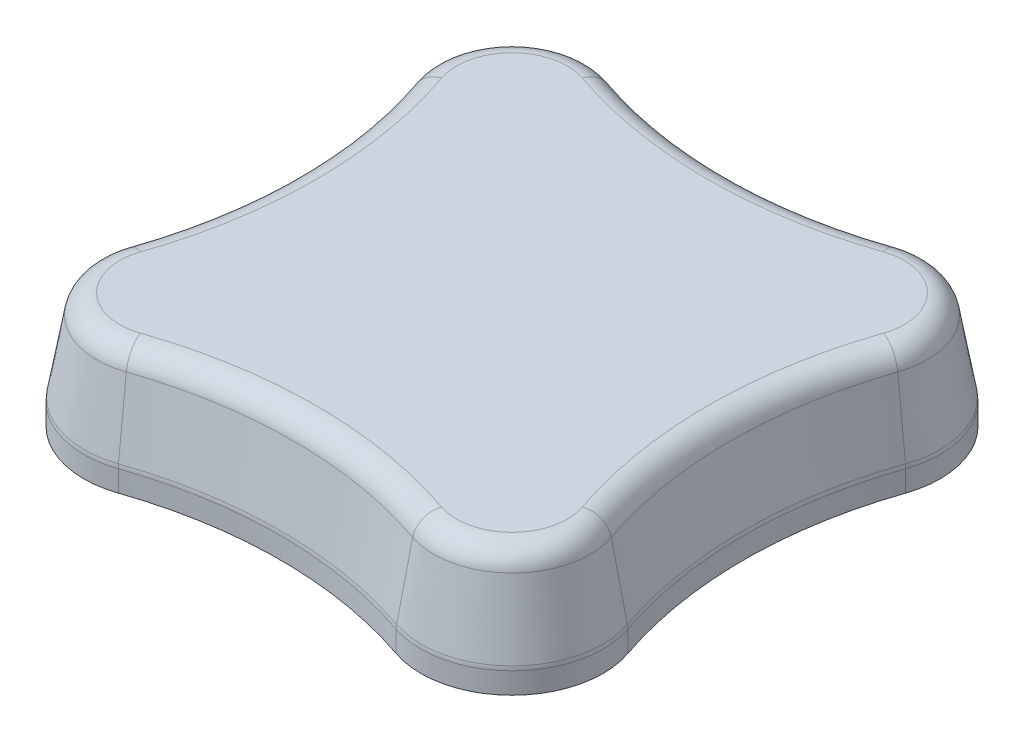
ISO-10303-21;
HEADER;
FILE_DESCRIPTION(('STEP AP214'),'2;1');
FILE_NAME('part.step','',(''),(''),'','','');
FILE_SCHEMA(('AUTOMOTIVE_DESIGN { 1 0 10303 214 1 1 1 1 }'));
ENDSEC;
DATA;
#1=APPLICATION_CONTEXT('core data for automotive mechanical design processes');
#2=APPLICATION_PROTOCOL_DEFINITION('international standard','automotive_design',2000,#1);
#3=PRODUCT_CONTEXT('',#1,'mechanical');
#4=PRODUCT('Part','Part','',(#3));
#5=PRODUCT_RELATED_PRODUCT_CATEGORY('part','',(#4));
#6=PRODUCT_DEFINITION_FORMATION('','',#4);
#7=PRODUCT_DEFINITION_CONTEXT('part definition',#1,'design');
#8=PRODUCT_DEFINITION('design','',#6,#7);
#9=PRODUCT_DEFINITION_SHAPE('','',#8);
#10=(LENGTH_UNIT() NAMED_UNIT(*) SI_UNIT(.MILLI.,.METRE.));
#11=(NAMED_UNIT(*) PLANE_ANGLE_UNIT() SI_UNIT($,.RADIAN.));
#12=(NAMED_UNIT(*) SI_UNIT($,.STERADIAN.) SOLID_ANGLE_UNIT());
#13=UNCERTAINTY_MEASURE_WITH_UNIT(LENGTH_MEASURE(1.E-05),#10,'distance_accuracy_value','');
#14=(GEOMETRIC_REPRESENTATION_CONTEXT(3) GLOBAL_UNCERTAINTY_ASSIGNED_CONTEXT((#13)) GLOBAL_UNIT_ASSIGNED_CONTEXT((#10,
#11,#12)) REPRESENTATION_CONTEXT('',''));
#15=CARTESIAN_POINT('',(0.,0.,0.));
#16=DIRECTION('',(0.,0.,1.));
#17=DIRECTION('',(1.,0.,0.));
#18=AXIS2_PLACEMENT_3D('',#15,#16,#17);
#19=CARTESIAN_POINT('',(-113.590691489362,-3.175,-23.1031914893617));
#20=DIRECTION('',(0.,1.,0.));
#21=DIRECTION('',(0.,0.,1.));
#22=AXIS2_PLACEMENT_3D('',#19,#20,#21);
#23=PLANE('',#22);
#24=CARTESIAN_POINT('',(-46.2063829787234,-3.175,-46.2063829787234));
#25=DIRECTION('',(0.,1.,0.));
#26=DIRECTION('',(0.,0.,1.));
#27=AXIS2_PLACEMENT_3D('',#24,#25,#26);
#28=CIRCLE('',#27,24.9946808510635);
#29=CARTESIAN_POINT('',(-38.1000000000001,-3.175,-69.85));
#30=VERTEX_POINT('',#29);
#31=CARTESIAN_POINT('',(-69.8500000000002,-3.175,-38.1000000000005));
#32=VERTEX_POINT('',#31);
#33=EDGE_CURVE('E401',#30,#32,#28,.T.);
#34=ORIENTED_EDGE('',*,*,#33,.F.);
#35=CARTESIAN_POINT('',(0.,-3.175,-180.975));
#36=DIRECTION('',(0.,-1.,0.));
#37=DIRECTION('',(0.,0.,1.));
#38=AXIS2_PLACEMENT_3D('',#35,#36,#37);
#39=CIRCLE('',#38,117.475);
#40=CARTESIAN_POINT('',(38.1000000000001,-3.175,-69.85));
#41=VERTEX_POINT('',#40);
#42=EDGE_CURVE('E444',#41,#30,#39,.T.);
#43=ORIENTED_EDGE('',*,*,#42,.F.);
#44=CARTESIAN_POINT('',(46.2063829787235,-3.175,-46.2063829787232));
#45=DIRECTION('',(0.,1.,0.));
#46=DIRECTION('',(0.,0.,1.));
#47=AXIS2_PLACEMENT_3D('',#44,#45,#46);
#48=CIRCLE('',#47,24.9946808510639);
#49=CARTESIAN_POINT('',(69.8500000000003,-3.175,-38.0999999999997));
#50=VERTEX_POINT('',#49);
#51=EDGE_CURVE('E441',#50,#41,#48,.T.);
#52=ORIENTED_EDGE('',*,*,#51,.F.);
#53=CARTESIAN_POINT('',(180.975,-3.175,0.));
#54=DIRECTION('',(0.,-1.,0.));
#55=DIRECTION('',(0.,0.,1.));
#56=AXIS2_PLACEMENT_3D('',#53,#54,#55);
#57=CIRCLE('',#56,117.475);
#58=CARTESIAN_POINT('',(69.85,-3.175,38.1000000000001));
#59=VERTEX_POINT('',#58);
#60=EDGE_CURVE('E438',#59,#50,#57,.T.);
#61=ORIENTED_EDGE('',*,*,#60,.F.);
#62=CARTESIAN_POINT('',(46.206382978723,-3.175,46.2063829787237));
#63=DIRECTION('',(0.,1.,0.));
#64=DIRECTION('',(0.,0.,1.));
#65=AXIS2_PLACEMENT_3D('',#62,#63,#64);
#66=CIRCLE('',#65,24.9946808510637);
#67=CARTESIAN_POINT('',(38.0999999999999,-3.175,69.8500000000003));
#68=VERTEX_POINT('',#67);
#69=EDGE_CURVE('E435',#68,#59,#66,.T.);
#70=ORIENTED_EDGE('',*,*,#69,.F.);
#71=CARTESIAN_POINT('',(0.,-3.175,180.975));
#72=DIRECTION('',(0.,-1.,0.));
#73=DIRECTION('',(0.,0.,1.));
#74=AXIS2_PLACEMENT_3D('',#71,#72,#73);
#75=CIRCLE('',#74,117.475);
#76=CARTESIAN_POINT('',(-38.1,-3.175,69.85));
#77=VERTEX_POINT('',#76);
#78=EDGE_CURVE('E432',#77,#68,#75,.T.);
#79=ORIENTED_EDGE('',*,*,#78,.F.);
#80=CARTESIAN_POINT('',(-46.2063829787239,-3.175,46.2063829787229));
#81=DIRECTION('',(0.,1.,0.));
#82=DIRECTION('',(0.,0.,1.));
#83=AXIS2_PLACEMENT_3D('',#80,#81,#82);
#84=CIRCLE('',#83,24.9946808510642);
#85=CARTESIAN_POINT('',(-69.8500000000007,-3.175,38.0999999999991));
#86=VERTEX_POINT('',#85);
#87=EDGE_CURVE('E429',#86,#77,#84,.T.);
#88=ORIENTED_EDGE('',*,*,#87,.F.);
#89=CARTESIAN_POINT('',(-180.975,-3.175,0.));
#90=DIRECTION('',(0.,-1.,0.));
#91=DIRECTION('',(0.,0.,1.));
#92=AXIS2_PLACEMENT_3D('',#89,#90,#91);
#93=CIRCLE('',#92,117.475);
#94=EDGE_CURVE('E426',#32,#86,#93,.T.);
#95=ORIENTED_EDGE('',*,*,#94,.F.);
#96=EDGE_LOOP('',(#34,#43,#52,#61,#70,#79,#88,#95));
#97=FACE_BOUND('',#96,.T.);
#98=CARTESIAN_POINT('',(0.,-3.175,-180.975));
#99=DIRECTION('',(0.,1.,0.));
#100=DIRECTION('',(0.,0.,1.));
#101=AXIS2_PLACEMENT_3D('',#98,#99,#100);
#102=CIRCLE('',#101,122.555);
#103=CARTESIAN_POINT('',(39.7475675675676,-3.175,-65.0445945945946));
#104=VERTEX_POINT('',#103);
#105=CARTESIAN_POINT('',(-39.7475675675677,-3.175,-65.0445945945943));
#106=VERTEX_POINT('',#105);
#107=EDGE_CURVE('E381',#104,#106,#102,.F.);
#108=ORIENTED_EDGE('',*,*,#107,.T.);
#109=CARTESIAN_POINT('',(-46.2063829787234,-3.175,-46.2063829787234));
#110=DIRECTION('',(0.,1.,0.));
#111=DIRECTION('',(0.,0.,1.));
#112=AXIS2_PLACEMENT_3D('',#109,#110,#111);
#113=CIRCLE('',#112,19.9146808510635);
#114=CARTESIAN_POINT('',(-65.0445945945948,-3.175,-39.7475675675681));
#115=VERTEX_POINT('',#114);
#116=EDGE_CURVE('E378',#106,#115,#113,.T.);
#117=ORIENTED_EDGE('',*,*,#116,.T.);
#118=CARTESIAN_POINT('',(-180.975,-3.175,0.));
#119=DIRECTION('',(0.,1.,0.));
#120=DIRECTION('',(0.,0.,1.));
#121=AXIS2_PLACEMENT_3D('',#118,#119,#120);
#122=CIRCLE('',#121,122.555);
#123=CARTESIAN_POINT('',(-65.0445945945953,-3.175,39.7475675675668));
#124=VERTEX_POINT('',#123);
#125=EDGE_CURVE('E310',#115,#124,#122,.F.);
#126=ORIENTED_EDGE('',*,*,#125,.T.);
#127=CARTESIAN_POINT('',(-46.2063829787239,-3.175,46.2063829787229));
#128=DIRECTION('',(0.,1.,0.));
#129=DIRECTION('',(0.,0.,1.));
#130=AXIS2_PLACEMENT_3D('',#127,#128,#129);
#131=CIRCLE('',#130,19.9146808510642);
#132=CARTESIAN_POINT('',(-39.7475675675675,-3.175,65.0445945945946));
#133=VERTEX_POINT('',#132);
#134=EDGE_CURVE('E49',#124,#133,#131,.T.);
#135=ORIENTED_EDGE('',*,*,#134,.T.);
#136=CARTESIAN_POINT('',(0.,-3.175,180.975));
#137=DIRECTION('',(0.,1.,0.));
#138=DIRECTION('',(0.,0.,1.));
#139=AXIS2_PLACEMENT_3D('',#136,#137,#138);
#140=CIRCLE('',#139,122.555);
#141=CARTESIAN_POINT('',(39.7475675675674,-3.175,65.0445945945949));
#142=VERTEX_POINT('',#141);
#143=EDGE_CURVE('E393',#133,#142,#140,.F.);
#144=ORIENTED_EDGE('',*,*,#143,.T.);
#145=CARTESIAN_POINT('',(46.206382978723,-3.175,46.2063829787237));
#146=DIRECTION('',(0.,1.,0.));
#147=DIRECTION('',(0.,0.,1.));
#148=AXIS2_PLACEMENT_3D('',#145,#146,#147);
#149=CIRCLE('',#148,19.9146808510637);
#150=CARTESIAN_POINT('',(65.0445945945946,-3.175,39.7475675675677));
#151=VERTEX_POINT('',#150);
#152=EDGE_CURVE('E390',#142,#151,#149,.T.);
#153=ORIENTED_EDGE('',*,*,#152,.T.);
#154=CARTESIAN_POINT('',(180.975,-3.175,0.));
#155=DIRECTION('',(0.,1.,0.));
#156=DIRECTION('',(0.,0.,1.));
#157=AXIS2_PLACEMENT_3D('',#154,#155,#156);
#158=CIRCLE('',#157,122.555);
#159=CARTESIAN_POINT('',(65.0445945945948,-3.175,-39.7475675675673));
#160=VERTEX_POINT('',#159);
#161=EDGE_CURVE('E387',#151,#160,#158,.F.);
#162=ORIENTED_EDGE('',*,*,#161,.T.);
#163=CARTESIAN_POINT('',(46.2063829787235,-3.175,-46.2063829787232));
#164=DIRECTION('',(0.,1.,0.));
#165=DIRECTION('',(0.,0.,1.));
#166=AXIS2_PLACEMENT_3D('',#163,#164,#165);
#167=CIRCLE('',#166,19.9146808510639);
#168=EDGE_CURVE('E384',#160,#104,#167,.T.);
#169=ORIENTED_EDGE('',*,*,#168,.T.);
#170=EDGE_LOOP('',(#108,#117,#126,#135,#144,#153,#162,#169));
#171=FACE_BOUND('',#170,.T.);
#172=ADVANCED_FACE('F34',(#97,#171),#23,.F.);
#173=CARTESIAN_POINT('',(-46.2063829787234,3.175,-46.2063829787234));
#174=DIRECTION('',(0.,-1.,0.));
#175=DIRECTION('',(0.,0.,-1.));
#176=AXIS2_PLACEMENT_3D('',#173,#174,#175);
#177=CYLINDRICAL_SURFACE('',#176,24.9946808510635);
#178=DIRECTION('',(0.,-1.,0.));
#179=VECTOR('',#178,1.);
#180=CARTESIAN_POINT('',(-69.8500000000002,3.175,-38.1000000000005));
#181=LINE('',#180,#179);
#182=CARTESIAN_POINT('',(-69.8500000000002,2.61944698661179,-38.1000000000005));
#183=VERTEX_POINT('',#182);
#184=EDGE_CURVE('E461',#183,#32,#181,.T.);
#185=ORIENTED_EDGE('',*,*,#184,.F.);
#186=CARTESIAN_POINT('',(-46.2063829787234,2.6194469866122,-46.2063829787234));
#187=DIRECTION('',(0.,-1.,0.));
#188=DIRECTION('',(0.,0.,-1.));
#189=AXIS2_PLACEMENT_3D('',#186,#187,#188);
#190=CIRCLE('',#189,24.9946808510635);
#191=CARTESIAN_POINT('',(-38.1000000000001,2.61944698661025,-69.85));
#192=VERTEX_POINT('',#191);
#193=EDGE_CURVE('E468',#183,#192,#190,.T.);
#194=ORIENTED_EDGE('',*,*,#193,.T.);
#195=DIRECTION('',(0.,-1.,0.));
#196=VECTOR('',#195,1.);
#197=CARTESIAN_POINT('',(-38.1000000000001,3.175,-69.85));
#198=LINE('',#197,#196);
#199=EDGE_CURVE('E447',#192,#30,#198,.T.);
#200=ORIENTED_EDGE('',*,*,#199,.T.);
#201=ORIENTED_EDGE('',*,*,#33,.T.);
#202=EDGE_LOOP('',(#185,#194,#200,#201));
#203=FACE_BOUND('',#202,.T.);
#204=ADVANCED_FACE('F607',(#203),#177,.T.);
#205=CARTESIAN_POINT('',(-180.975,3.175,0.));
#206=DIRECTION('',(0.,-1.,0.));
#207=DIRECTION('',(0.,0.,-1.));
#208=AXIS2_PLACEMENT_3D('',#205,#206,#207);
#209=CYLINDRICAL_SURFACE('',#208,117.475);
#210=DIRECTION('',(0.,-1.,0.));
#211=VECTOR('',#210,1.);
#212=CARTESIAN_POINT('',(-69.8500000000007,3.175,38.0999999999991));
#213=LINE('',#212,#211);
#214=CARTESIAN_POINT('',(-69.8500000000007,2.61944698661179,38.0999999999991));
#215=VERTEX_POINT('',#214);
#216=EDGE_CURVE('E459',#215,#86,#213,.T.);
#217=ORIENTED_EDGE('',*,*,#216,.F.);
#218=CARTESIAN_POINT('',(-180.975,2.61944698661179,0.));
#219=DIRECTION('',(0.,1.,0.));
#220=DIRECTION('',(0.,0.,1.));
#221=AXIS2_PLACEMENT_3D('',#218,#219,#220);
#222=CIRCLE('',#221,117.475);
#223=EDGE_CURVE('E527',#215,#183,#222,.T.);
#224=ORIENTED_EDGE('',*,*,#223,.T.);
#225=ORIENTED_EDGE('',*,*,#184,.T.);
#226=ORIENTED_EDGE('',*,*,#94,.T.);
#227=EDGE_LOOP('',(#217,#224,#225,#226));
#228=FACE_BOUND('',#227,.T.);
#229=ADVANCED_FACE('F613',(#228),#209,.F.);
#230=CARTESIAN_POINT('',(-46.2063829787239,3.175,46.2063829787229));
#231=DIRECTION('',(0.,-1.,0.));
#232=DIRECTION('',(0.,0.,-1.));
#233=AXIS2_PLACEMENT_3D('',#230,#231,#232);
#234=CYLINDRICAL_SURFACE('',#233,24.9946808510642);
#235=DIRECTION('',(0.,-1.,0.));
#236=VECTOR('',#235,1.);
#237=CARTESIAN_POINT('',(-38.1,3.175,69.85));
#238=LINE('',#237,#236);
#239=CARTESIAN_POINT('',(-38.1,2.6194469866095,69.85));
#240=VERTEX_POINT('',#239);
#241=EDGE_CURVE('E457',#240,#77,#238,.T.);
#242=ORIENTED_EDGE('',*,*,#241,.F.);
#243=CARTESIAN_POINT('',(-46.2063829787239,2.6194469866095,46.2063829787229));
#244=DIRECTION('',(0.,-1.,0.));
#245=DIRECTION('',(0.,0.,-1.));
#246=AXIS2_PLACEMENT_3D('',#243,#244,#245);
#247=CIRCLE('',#246,24.9946808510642);
#248=EDGE_CURVE('E506',#240,#215,#247,.T.);
#249=ORIENTED_EDGE('',*,*,#248,.T.);
#250=ORIENTED_EDGE('',*,*,#216,.T.);
#251=ORIENTED_EDGE('',*,*,#87,.T.);
#252=EDGE_LOOP('',(#242,#249,#250,#251));
#253=FACE_BOUND('',#252,.T.);
#254=ADVANCED_FACE('F642',(#253),#234,.T.);
#255=CARTESIAN_POINT('',(0.,3.175,180.975));
#256=DIRECTION('',(0.,-1.,0.));
#257=DIRECTION('',(0.,0.,-1.));
#258=AXIS2_PLACEMENT_3D('',#255,#256,#257);
#259=CYLINDRICAL_SURFACE('',#258,117.475);
#260=DIRECTION('',(0.,-1.,0.));
#261=VECTOR('',#260,1.);
#262=CARTESIAN_POINT('',(38.0999999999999,3.175,69.8500000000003));
#263=LINE('',#262,#261);
#264=CARTESIAN_POINT('',(38.0999999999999,2.61944698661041,69.8500000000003));
#265=VERTEX_POINT('',#264);
#266=EDGE_CURVE('E455',#265,#68,#263,.T.);
#267=ORIENTED_EDGE('',*,*,#266,.F.);
#268=CARTESIAN_POINT('',(0.,2.61944698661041,180.975));
#269=DIRECTION('',(0.,1.,0.));
#270=DIRECTION('',(0.,0.,1.));
#271=AXIS2_PLACEMENT_3D('',#268,#269,#270);
#272=CIRCLE('',#271,117.475);
#273=EDGE_CURVE('E500',#265,#240,#272,.T.);
#274=ORIENTED_EDGE('',*,*,#273,.T.);
#275=ORIENTED_EDGE('',*,*,#241,.T.);
#276=ORIENTED_EDGE('',*,*,#78,.T.);
#277=EDGE_LOOP('',(#267,#274,#275,#276));
#278=FACE_BOUND('',#277,.T.);
#279=ADVANCED_FACE('F638',(#278),#259,.F.);
#280=CARTESIAN_POINT('',(46.206382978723,3.175,46.2063829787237));
#281=DIRECTION('',(0.,-1.,0.));
#282=DIRECTION('',(0.,0.,-1.));
#283=AXIS2_PLACEMENT_3D('',#280,#281,#282);
#284=CYLINDRICAL_SURFACE('',#283,24.9946808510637);
#285=DIRECTION('',(0.,-1.,0.));
#286=VECTOR('',#285,1.);
#287=CARTESIAN_POINT('',(69.85,3.175,38.1000000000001));
#288=LINE('',#287,#286);
#289=CARTESIAN_POINT('',(69.85,2.61944698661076,38.1000000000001));
#290=VERTEX_POINT('',#289);
#291=EDGE_CURVE('E453',#290,#59,#288,.T.);
#292=ORIENTED_EDGE('',*,*,#291,.F.);
#293=CARTESIAN_POINT('',(46.206382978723,2.61944698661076,46.2063829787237));
#294=DIRECTION('',(0.,-1.,0.));
#295=DIRECTION('',(0.,0.,-1.));
#296=AXIS2_PLACEMENT_3D('',#293,#294,#295);
#297=CIRCLE('',#296,24.9946808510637);
#298=EDGE_CURVE('E494',#290,#265,#297,.T.);
#299=ORIENTED_EDGE('',*,*,#298,.T.);
#300=ORIENTED_EDGE('',*,*,#266,.T.);
#301=ORIENTED_EDGE('',*,*,#69,.T.);
#302=EDGE_LOOP('',(#292,#299,#300,#301));
#303=FACE_BOUND('',#302,.T.);
#304=ADVANCED_FACE('F634',(#303),#284,.T.);
#305=CARTESIAN_POINT('',(180.975,3.175,0.));
#306=DIRECTION('',(0.,-1.,0.));
#307=DIRECTION('',(0.,0.,-1.));
#308=AXIS2_PLACEMENT_3D('',#305,#306,#307);
#309=CYLINDRICAL_SURFACE('',#308,117.475);
#310=DIRECTION('',(0.,-1.,0.));
#311=VECTOR('',#310,1.);
#312=CARTESIAN_POINT('',(69.8500000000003,3.175,-38.0999999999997));
#313=LINE('',#312,#311);
#314=CARTESIAN_POINT('',(69.8500000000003,2.61944698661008,-38.0999999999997));
#315=VERTEX_POINT('',#314);
#316=EDGE_CURVE('E451',#315,#50,#313,.T.);
#317=ORIENTED_EDGE('',*,*,#316,.F.);
#318=CARTESIAN_POINT('',(180.975,2.61944698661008,0.));
#319=DIRECTION('',(0.,1.,0.));
#320=DIRECTION('',(0.,0.,1.));
#321=AXIS2_PLACEMENT_3D('',#318,#319,#320);
#322=CIRCLE('',#321,117.475);
#323=EDGE_CURVE('E488',#315,#290,#322,.T.);
#324=ORIENTED_EDGE('',*,*,#323,.T.);
#325=ORIENTED_EDGE('',*,*,#291,.T.);
#326=ORIENTED_EDGE('',*,*,#60,.T.);
#327=EDGE_LOOP('',(#317,#324,#325,#326));
#328=FACE_BOUND('',#327,.T.);
#329=ADVANCED_FACE('F630',(#328),#309,.F.);
#330=CARTESIAN_POINT('',(46.2063829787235,3.175,-46.2063829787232));
#331=DIRECTION('',(0.,-1.,0.));
#332=DIRECTION('',(0.,0.,-1.));
#333=AXIS2_PLACEMENT_3D('',#330,#331,#332);
#334=CYLINDRICAL_SURFACE('',#333,24.9946808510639);
#335=DIRECTION('',(0.,-1.,0.));
#336=VECTOR('',#335,1.);
#337=CARTESIAN_POINT('',(38.1000000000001,3.175,-69.85));
#338=LINE('',#337,#336);
#339=CARTESIAN_POINT('',(38.1000000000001,2.6194469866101,-69.85));
#340=VERTEX_POINT('',#339);
#341=EDGE_CURVE('E449',#340,#41,#338,.T.);
#342=ORIENTED_EDGE('',*,*,#341,.F.);
#343=CARTESIAN_POINT('',(46.2063829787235,2.6194469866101,-46.2063829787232));
#344=DIRECTION('',(0.,-1.,0.));
#345=DIRECTION('',(0.,0.,-1.));
#346=AXIS2_PLACEMENT_3D('',#343,#344,#345);
#347=CIRCLE('',#346,24.9946808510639);
#348=EDGE_CURVE('E482',#340,#315,#347,.T.);
#349=ORIENTED_EDGE('',*,*,#348,.T.);
#350=ORIENTED_EDGE('',*,*,#316,.T.);
#351=ORIENTED_EDGE('',*,*,#51,.T.);
#352=EDGE_LOOP('',(#342,#349,#350,#351));
#353=FACE_BOUND('',#352,.T.);
#354=ADVANCED_FACE('F626',(#353),#334,.T.);
#355=CARTESIAN_POINT('',(0.,3.175,-180.975));
#356=DIRECTION('',(0.,-1.,0.));
#357=DIRECTION('',(0.,0.,-1.));
#358=AXIS2_PLACEMENT_3D('',#355,#356,#357);
#359=CYLINDRICAL_SURFACE('',#358,117.475);
#360=ORIENTED_EDGE('',*,*,#199,.F.);
#361=CARTESIAN_POINT('',(0.,2.61944698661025,-180.975));
#362=DIRECTION('',(0.,1.,0.));
#363=DIRECTION('',(0.,0.,1.));
#364=AXIS2_PLACEMENT_3D('',#361,#362,#363);
#365=CIRCLE('',#364,117.475);
#366=EDGE_CURVE('E475',#192,#340,#365,.T.);
#367=ORIENTED_EDGE('',*,*,#366,.T.);
#368=ORIENTED_EDGE('',*,*,#341,.T.);
#369=ORIENTED_EDGE('',*,*,#42,.T.);
#370=EDGE_LOOP('',(#360,#367,#368,#369));
#371=FACE_BOUND('',#370,.T.);
#372=ADVANCED_FACE('F622',(#371),#359,.F.);
#373=CARTESIAN_POINT('',(0.,3.175,-180.975));
#374=DIRECTION('',(0.,1.,0.));
#375=DIRECTION('',(0.,0.,1.));
#376=AXIS2_PLACEMENT_3D('',#373,#374,#375);
#377=CONICAL_SURFACE('',#376,117.475,0.174532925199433);
#378=DIRECTION('',(-0.0563183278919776,-0.984807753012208,-0.164261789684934));
#379=VECTOR('',#378,1.);
#380=CARTESIAN_POINT('',(38.1000000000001,3.17500000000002,-69.85));
#381=LINE('',#380,#379);
#382=CARTESIAN_POINT('',(39.252473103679,23.327665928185,-66.4886201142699));
#383=VERTEX_POINT('',#382);
#384=CARTESIAN_POINT('',(38.1312878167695,3.72211291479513,-69.7587438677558));
#385=VERTEX_POINT('',#384);
#386=EDGE_CURVE('E403',#383,#385,#381,.T.);
#387=ORIENTED_EDGE('',*,*,#386,.T.);
#388=CARTESIAN_POINT('',(0.,3.72211291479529,-180.975));
#389=DIRECTION('',(0.,-1.,0.));
#390=DIRECTION('',(0.,0.,-1.));
#391=AXIS2_PLACEMENT_3D('',#388,#389,#390);
#392=CIRCLE('',#391,117.571470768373);
#393=CARTESIAN_POINT('',(-38.1312878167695,3.72211291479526,-69.7587438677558));
#394=VERTEX_POINT('',#393);
#395=EDGE_CURVE('E473',#385,#394,#392,.T.);
#396=ORIENTED_EDGE('',*,*,#395,.T.);
#397=DIRECTION('',(0.0563183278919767,-0.984807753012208,-0.164261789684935));
#398=VECTOR('',#397,1.);
#399=CARTESIAN_POINT('',(-38.1000000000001,3.175,-69.85));
#400=LINE('',#399,#398);
#401=CARTESIAN_POINT('',(-39.2524731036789,23.327665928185,-66.4886201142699));
#402=VERTEX_POINT('',#401);
#403=EDGE_CURVE('E398',#402,#394,#400,.T.);
#404=ORIENTED_EDGE('',*,*,#403,.F.);
#405=CARTESIAN_POINT('',(0.,23.327665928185,-180.975));
#406=DIRECTION('',(0.,1.,0.));
#407=DIRECTION('',(0.,0.,1.));
#408=AXIS2_PLACEMENT_3D('',#405,#406,#407);
#409=CIRCLE('',#408,121.028458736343);
#410=EDGE_CURVE('E471',#402,#383,#409,.T.);
#411=ORIENTED_EDGE('',*,*,#410,.T.);
#412=EDGE_LOOP('',(#387,#396,#404,#411));
#413=FACE_BOUND('',#412,.T.);
#414=ADVANCED_FACE('F625',(#413),#377,.F.);
#415=CARTESIAN_POINT('',(-46.2063829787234,3.175,-46.2063829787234));
#416=DIRECTION('',(0.,-1.,0.));
#417=DIRECTION('',(0.,0.,1.));
#418=AXIS2_PLACEMENT_3D('',#415,#416,#417);
#419=CONICAL_SURFACE('',#418,24.9946808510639,0.174532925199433);
#420=ORIENTED_EDGE('',*,*,#403,.T.);
#421=CARTESIAN_POINT('',(-46.2063829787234,3.72211291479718,-46.2063829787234));
#422=DIRECTION('',(0.,1.,0.));
#423=DIRECTION('',(0.,0.,1.));
#424=AXIS2_PLACEMENT_3D('',#421,#422,#423);
#425=CIRCLE('',#424,24.8982100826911);
#426=CARTESIAN_POINT('',(-69.758743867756,3.72211291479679,-38.13128781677));
#427=VERTEX_POINT('',#426);
#428=EDGE_CURVE('E465',#394,#427,#425,.T.);
#429=ORIENTED_EDGE('',*,*,#428,.T.);
#430=DIRECTION('',(-0.164261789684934,-0.984807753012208,0.0563183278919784));
#431=VECTOR('',#430,1.);
#432=CARTESIAN_POINT('',(-69.8500000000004,3.17500000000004,-38.1000000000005));
#433=LINE('',#432,#431);
#434=CARTESIAN_POINT('',(-66.4886201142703,23.3276659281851,-39.2524731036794));
#435=VERTEX_POINT('',#434);
#436=EDGE_CURVE('E402',#435,#427,#433,.T.);
#437=ORIENTED_EDGE('',*,*,#436,.F.);
#438=CARTESIAN_POINT('',(-46.2063829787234,23.327665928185,-46.2063829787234));
#439=DIRECTION('',(0.,-1.,0.));
#440=DIRECTION('',(0.,0.,-1.));
#441=AXIS2_PLACEMENT_3D('',#438,#439,#440);
#442=CIRCLE('',#441,21.4412221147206);
#443=EDGE_CURVE('E463',#435,#402,#442,.T.);
#444=ORIENTED_EDGE('',*,*,#443,.T.);
#445=EDGE_LOOP('',(#420,#429,#437,#444));
#446=FACE_BOUND('',#445,.T.);
#447=ADVANCED_FACE('F620',(#446),#419,.T.);
#448=CARTESIAN_POINT('',(-180.975,3.175,0.));
#449=DIRECTION('',(0.,1.,0.));
#450=DIRECTION('',(0.,0.,1.));
#451=AXIS2_PLACEMENT_3D('',#448,#449,#450);
#452=CONICAL_SURFACE('',#451,117.475,0.174532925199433);
#453=DIRECTION('',(-0.164261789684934,-0.984807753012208,-0.0563183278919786));
#454=VECTOR('',#453,1.);
#455=CARTESIAN_POINT('',(-69.8500000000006,3.17500000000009,38.0999999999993));
#456=LINE('',#455,#454);
#457=CARTESIAN_POINT('',(-66.4886201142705,23.3276659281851,39.2524731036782));
#458=VERTEX_POINT('',#457);
#459=CARTESIAN_POINT('',(-69.7587438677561,3.72211291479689,38.1312878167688));
#460=VERTEX_POINT('',#459);
#461=EDGE_CURVE('E419',#458,#460,#456,.T.);
#462=ORIENTED_EDGE('',*,*,#461,.F.);
#463=CARTESIAN_POINT('',(-180.975,23.327665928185,0.));
#464=DIRECTION('',(0.,1.,0.));
#465=DIRECTION('',(0.,0.,1.));
#466=AXIS2_PLACEMENT_3D('',#463,#464,#465);
#467=CIRCLE('',#466,121.028458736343);
#468=EDGE_CURVE('E525',#458,#435,#467,.T.);
#469=ORIENTED_EDGE('',*,*,#468,.T.);
#470=ORIENTED_EDGE('',*,*,#436,.T.);
#471=CARTESIAN_POINT('',(-180.975,3.72211291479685,0.));
#472=DIRECTION('',(0.,-1.,0.));
#473=DIRECTION('',(0.,0.,-1.));
#474=AXIS2_PLACEMENT_3D('',#471,#472,#473);
#475=CIRCLE('',#474,117.571470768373);
#476=EDGE_CURVE('E523',#427,#460,#475,.T.);
#477=ORIENTED_EDGE('',*,*,#476,.T.);
#478=EDGE_LOOP('',(#462,#469,#470,#477));
#479=FACE_BOUND('',#478,.T.);
#480=ADVANCED_FACE('F885',(#479),#452,.F.);
#481=CARTESIAN_POINT('',(-46.2063829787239,3.175,46.2063829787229));
#482=DIRECTION('',(0.,-1.,0.));
#483=DIRECTION('',(0.,0.,1.));
#484=AXIS2_PLACEMENT_3D('',#481,#482,#483);
#485=CONICAL_SURFACE('',#484,24.994680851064,0.174532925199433);
#486=ORIENTED_EDGE('',*,*,#461,.T.);
#487=CARTESIAN_POINT('',(-46.2063829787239,3.72211291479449,46.2063829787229));
#488=DIRECTION('',(0.,1.,0.));
#489=DIRECTION('',(0.,0.,1.));
#490=AXIS2_PLACEMENT_3D('',#487,#488,#489);
#491=CIRCLE('',#490,24.8982100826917);
#492=CARTESIAN_POINT('',(-38.1312878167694,3.72211291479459,69.7587438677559));
#493=VERTEX_POINT('',#492);
#494=EDGE_CURVE('E504',#460,#493,#491,.T.);
#495=ORIENTED_EDGE('',*,*,#494,.T.);
#496=DIRECTION('',(0.0563183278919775,-0.984807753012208,0.164261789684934));
#497=VECTOR('',#496,1.);
#498=CARTESIAN_POINT('',(-38.1,3.17500000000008,69.85));
#499=LINE('',#498,#497);
#500=CARTESIAN_POINT('',(-39.2524731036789,23.3276659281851,66.4886201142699));
#501=VERTEX_POINT('',#500);
#502=EDGE_CURVE('E416',#501,#493,#499,.T.);
#503=ORIENTED_EDGE('',*,*,#502,.F.);
#504=CARTESIAN_POINT('',(-46.2063829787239,23.327665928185,46.2063829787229));
#505=DIRECTION('',(0.,-1.,0.));
#506=DIRECTION('',(0.,0.,-1.));
#507=AXIS2_PLACEMENT_3D('',#504,#505,#506);
#508=CIRCLE('',#507,21.4412221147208);
#509=EDGE_CURVE('E502',#501,#458,#508,.T.);
#510=ORIENTED_EDGE('',*,*,#509,.T.);
#511=EDGE_LOOP('',(#486,#495,#503,#510));
#512=FACE_BOUND('',#511,.T.);
#513=ADVANCED_FACE('F882',(#512),#485,.T.);
#514=CARTESIAN_POINT('',(0.,3.175,180.975));
#515=DIRECTION('',(0.,1.,0.));
#516=DIRECTION('',(0.,0.,1.));
#517=AXIS2_PLACEMENT_3D('',#514,#515,#516);
#518=CONICAL_SURFACE('',#517,117.475,0.174532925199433);
#519=ORIENTED_EDGE('',*,*,#502,.T.);
#520=CARTESIAN_POINT('',(0.,3.72211291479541,180.975));
#521=DIRECTION('',(0.,-1.,0.));
#522=DIRECTION('',(0.,0.,-1.));
#523=AXIS2_PLACEMENT_3D('',#520,#521,#522);
#524=CIRCLE('',#523,117.571470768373);
#525=CARTESIAN_POINT('',(38.1312878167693,3.72211291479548,69.7587438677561));
#526=VERTEX_POINT('',#525);
#527=EDGE_CURVE('E498',#493,#526,#524,.T.);
#528=ORIENTED_EDGE('',*,*,#527,.T.);
#529=DIRECTION('',(-0.0563183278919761,-0.984807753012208,0.164261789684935));
#530=VECTOR('',#529,1.);
#531=CARTESIAN_POINT('',(38.0999999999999,3.17500000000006,69.8500000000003));
#532=LINE('',#531,#530);
#533=CARTESIAN_POINT('',(39.2524731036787,23.3276659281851,66.4886201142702));
#534=VERTEX_POINT('',#533);
#535=EDGE_CURVE('E413',#534,#526,#532,.T.);
#536=ORIENTED_EDGE('',*,*,#535,.F.);
#537=CARTESIAN_POINT('',(0.,23.327665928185,180.975));
#538=DIRECTION('',(0.,1.,0.));
#539=DIRECTION('',(0.,0.,1.));
#540=AXIS2_PLACEMENT_3D('',#537,#538,#539);
#541=CIRCLE('',#540,121.028458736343);
#542=EDGE_CURVE('E496',#534,#501,#541,.T.);
#543=ORIENTED_EDGE('',*,*,#542,.T.);
#544=EDGE_LOOP('',(#519,#528,#536,#543));
#545=FACE_BOUND('',#544,.T.);
#546=ADVANCED_FACE('F878',(#545),#518,.F.);
#547=CARTESIAN_POINT('',(46.206382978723,3.175,46.2063829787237));
#548=DIRECTION('',(0.,-1.,0.));
#549=DIRECTION('',(0.,0.,1.));
#550=AXIS2_PLACEMENT_3D('',#547,#548,#549);
#551=CONICAL_SURFACE('',#550,24.9946808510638,0.174532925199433);
#552=ORIENTED_EDGE('',*,*,#535,.T.);
#553=CARTESIAN_POINT('',(46.206382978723,3.72211291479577,46.2063829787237));
#554=DIRECTION('',(0.,1.,0.));
#555=DIRECTION('',(0.,0.,1.));
#556=AXIS2_PLACEMENT_3D('',#553,#554,#555);
#557=CIRCLE('',#556,24.8982100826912);
#558=CARTESIAN_POINT('',(69.7587438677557,3.72211291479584,38.1312878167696));
#559=VERTEX_POINT('',#558);
#560=EDGE_CURVE('E492',#526,#559,#557,.T.);
#561=ORIENTED_EDGE('',*,*,#560,.T.);
#562=DIRECTION('',(0.164261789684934,-0.984807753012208,-0.0563183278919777));
#563=VECTOR('',#562,1.);
#564=CARTESIAN_POINT('',(69.85,3.17500000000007,38.1000000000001));
#565=LINE('',#564,#563);
#566=CARTESIAN_POINT('',(66.4886201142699,23.3276659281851,39.252473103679));
#567=VERTEX_POINT('',#566);
#568=EDGE_CURVE('E410',#567,#559,#565,.T.);
#569=ORIENTED_EDGE('',*,*,#568,.F.);
#570=CARTESIAN_POINT('',(46.206382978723,23.327665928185,46.2063829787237));
#571=DIRECTION('',(0.,-1.,0.));
#572=DIRECTION('',(0.,0.,-1.));
#573=AXIS2_PLACEMENT_3D('',#570,#571,#572);
#574=CIRCLE('',#573,21.4412221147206);
#575=EDGE_CURVE('E490',#567,#534,#574,.T.);
#576=ORIENTED_EDGE('',*,*,#575,.T.);
#577=EDGE_LOOP('',(#552,#561,#569,#576));
#578=FACE_BOUND('',#577,.T.);
#579=ADVANCED_FACE('F874',(#578),#551,.T.);
#580=CARTESIAN_POINT('',(180.975,3.175,0.));
#581=DIRECTION('',(0.,1.,0.));
#582=DIRECTION('',(0.,0.,1.));
#583=AXIS2_PLACEMENT_3D('',#580,#581,#582);
#584=CONICAL_SURFACE('',#583,117.475,0.174532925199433);
#585=ORIENTED_EDGE('',*,*,#568,.T.);
#586=CARTESIAN_POINT('',(180.975,3.72211291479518,0.));
#587=DIRECTION('',(0.,-1.,0.));
#588=DIRECTION('',(0.,0.,-1.));
#589=AXIS2_PLACEMENT_3D('',#586,#587,#588);
#590=CIRCLE('',#589,117.571470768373);
#591=CARTESIAN_POINT('',(69.758743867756,3.72211291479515,-38.1312878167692));
#592=VERTEX_POINT('',#591);
#593=EDGE_CURVE('E486',#559,#592,#590,.T.);
#594=ORIENTED_EDGE('',*,*,#593,.T.);
#595=DIRECTION('',(0.164261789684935,-0.984807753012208,0.0563183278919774));
#596=VECTOR('',#595,1.);
#597=CARTESIAN_POINT('',(69.8500000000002,3.17500000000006,-38.0999999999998));
#598=LINE('',#597,#596);
#599=CARTESIAN_POINT('',(66.4886201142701,23.3276659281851,-39.2524731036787));
#600=VERTEX_POINT('',#599);
#601=EDGE_CURVE('E406',#600,#592,#598,.T.);
#602=ORIENTED_EDGE('',*,*,#601,.F.);
#603=CARTESIAN_POINT('',(180.975,23.327665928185,0.));
#604=DIRECTION('',(0.,1.,0.));
#605=DIRECTION('',(0.,0.,1.));
#606=AXIS2_PLACEMENT_3D('',#603,#604,#605);
#607=CIRCLE('',#606,121.028458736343);
#608=EDGE_CURVE('E484',#600,#567,#607,.T.);
#609=ORIENTED_EDGE('',*,*,#608,.T.);
#610=EDGE_LOOP('',(#585,#594,#602,#609));
#611=FACE_BOUND('',#610,.T.);
#612=ADVANCED_FACE('F870',(#611),#584,.F.);
#613=CARTESIAN_POINT('',(46.2063829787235,3.175,-46.2063829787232));
#614=DIRECTION('',(0.,-1.,0.));
#615=DIRECTION('',(0.,0.,1.));
#616=AXIS2_PLACEMENT_3D('',#613,#614,#615);
#617=CONICAL_SURFACE('',#616,24.9946808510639,0.174532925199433);
#618=ORIENTED_EDGE('',*,*,#601,.T.);
#619=CARTESIAN_POINT('',(46.2063829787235,3.72211291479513,-46.2063829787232));
#620=DIRECTION('',(0.,1.,0.));
#621=DIRECTION('',(0.,0.,1.));
#622=AXIS2_PLACEMENT_3D('',#619,#620,#621);
#623=CIRCLE('',#622,24.8982100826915);
#624=EDGE_CURVE('E480',#592,#385,#623,.T.);
#625=ORIENTED_EDGE('',*,*,#624,.T.);
#626=ORIENTED_EDGE('',*,*,#386,.F.);
#627=CARTESIAN_POINT('',(46.2063829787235,23.327665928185,-46.2063829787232));
#628=DIRECTION('',(0.,-1.,0.));
#629=DIRECTION('',(0.,0.,-1.));
#630=AXIS2_PLACEMENT_3D('',#627,#628,#629);
#631=CIRCLE('',#630,21.4412221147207);
#632=EDGE_CURVE('E477',#383,#600,#631,.T.);
#633=ORIENTED_EDGE('',*,*,#632,.T.);
#634=EDGE_LOOP('',(#618,#625,#626,#633));
#635=FACE_BOUND('',#634,.T.);
#636=ADVANCED_FACE('F864',(#635),#617,.T.);
#637=CARTESIAN_POINT('',(23.1031914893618,28.575,-113.590691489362));
#638=DIRECTION('',(0.,1.,0.));
#639=DIRECTION('',(0.,0.,1.));
#640=AXIS2_PLACEMENT_3D('',#637,#638,#639);
#641=PLANE('',#640);
#642=CARTESIAN_POINT('',(180.975,28.575,0.));
#643=DIRECTION('',(0.,1.,0.));
#644=DIRECTION('',(0.,0.,1.));
#645=AXIS2_PLACEMENT_3D('',#642,#643,#644);
#646=CIRCLE('',#645,127.281987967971);
#647=CARTESIAN_POINT('',(60.573119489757,28.575,41.2806447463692));
#648=VERTEX_POINT('',#647);
#649=CARTESIAN_POINT('',(60.5731194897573,28.575,-41.2806447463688));
#650=VERTEX_POINT('',#649);
#651=EDGE_CURVE('E57',#648,#650,#646,.F.);
#652=ORIENTED_EDGE('',*,*,#651,.T.);
#653=CARTESIAN_POINT('',(46.2063829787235,28.575,-46.2063829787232));
#654=DIRECTION('',(0.,1.,0.));
#655=DIRECTION('',(0.,0.,1.));
#656=AXIS2_PLACEMENT_3D('',#653,#654,#655);
#657=CIRCLE('',#656,15.1876928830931);
#658=CARTESIAN_POINT('',(41.280644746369,28.575,-60.5731194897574));
#659=VERTEX_POINT('',#658);
#660=EDGE_CURVE('E521',#650,#659,#657,.T.);
#661=ORIENTED_EDGE('',*,*,#660,.T.);
#662=CARTESIAN_POINT('',(0.,28.575,-180.975));
#663=DIRECTION('',(0.,1.,0.));
#664=DIRECTION('',(0.,0.,1.));
#665=AXIS2_PLACEMENT_3D('',#662,#663,#664);
#666=CIRCLE('',#665,127.281987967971);
#667=CARTESIAN_POINT('',(-41.2806447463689,28.575,-60.5731194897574));
#668=VERTEX_POINT('',#667);
#669=EDGE_CURVE('E508',#659,#668,#666,.F.);
#670=ORIENTED_EDGE('',*,*,#669,.T.);
#671=CARTESIAN_POINT('',(-46.2063829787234,28.575,-46.2063829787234));
#672=DIRECTION('',(0.,1.,0.));
#673=DIRECTION('',(0.,0.,1.));
#674=AXIS2_PLACEMENT_3D('',#671,#672,#673);
#675=CIRCLE('',#674,15.1876928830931);
#676=CARTESIAN_POINT('',(-60.5731194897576,28.575,-41.2806447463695));
#677=VERTEX_POINT('',#676);
#678=EDGE_CURVE('E510',#668,#677,#675,.T.);
#679=ORIENTED_EDGE('',*,*,#678,.T.);
#680=CARTESIAN_POINT('',(-180.975,28.575,0.));
#681=DIRECTION('',(0.,1.,0.));
#682=DIRECTION('',(0.,0.,1.));
#683=AXIS2_PLACEMENT_3D('',#680,#681,#682);
#684=CIRCLE('',#683,127.281987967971);
#685=CARTESIAN_POINT('',(-60.5731194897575,28.575,41.2806447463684));
#686=VERTEX_POINT('',#685);
#687=EDGE_CURVE('E512',#677,#686,#684,.F.);
#688=ORIENTED_EDGE('',*,*,#687,.T.);
#689=CARTESIAN_POINT('',(-46.2063829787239,28.575,46.2063829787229));
#690=DIRECTION('',(0.,1.,0.));
#691=DIRECTION('',(0.,0.,1.));
#692=AXIS2_PLACEMENT_3D('',#689,#690,#691);
#693=CIRCLE('',#692,15.1876928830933);
#694=CARTESIAN_POINT('',(-41.280644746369,28.575,60.5731194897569));
#695=VERTEX_POINT('',#694);
#696=EDGE_CURVE('E514',#686,#695,#693,.T.);
#697=ORIENTED_EDGE('',*,*,#696,.T.);
#698=CARTESIAN_POINT('',(0.,28.575,180.975));
#699=DIRECTION('',(0.,1.,0.));
#700=DIRECTION('',(0.,0.,1.));
#701=AXIS2_PLACEMENT_3D('',#698,#699,#700);
#702=CIRCLE('',#701,127.281987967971);
#703=CARTESIAN_POINT('',(41.2806447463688,28.575,60.5731194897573));
#704=VERTEX_POINT('',#703);
#705=EDGE_CURVE('E516',#695,#704,#702,.F.);
#706=ORIENTED_EDGE('',*,*,#705,.T.);
#707=CARTESIAN_POINT('',(46.206382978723,28.575,46.2063829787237));
#708=DIRECTION('',(0.,1.,0.));
#709=DIRECTION('',(0.,0.,1.));
#710=AXIS2_PLACEMENT_3D('',#707,#708,#709);
#711=CIRCLE('',#710,15.187692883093);
#712=EDGE_CURVE('E518',#704,#648,#711,.T.);
#713=ORIENTED_EDGE('',*,*,#712,.T.);
#714=EDGE_LOOP('',(#652,#661,#670,#679,#688,#697,#706,#713));
#715=FACE_BOUND('',#714,.T.);
#716=ADVANCED_FACE('F682',(#715),#641,.T.);
#717=CARTESIAN_POINT('',(46.206382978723,2.61944698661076,46.2063829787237));
#718=DIRECTION('',(0.,-1.,0.));
#719=DIRECTION('',(0.,0.,-1.));
#720=AXIS2_PLACEMENT_3D('',#717,#718,#719);
#721=TOROIDAL_SURFACE('',#720,18.6446808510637,6.35);
#722=CARTESIAN_POINT('',(40.1594594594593,2.61944698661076,63.8432432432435));
#723=DIRECTION('',(-0.945945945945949,0.,-0.324324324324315));
#724=DIRECTION('',(-0.324324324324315,0.,0.945945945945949));
#725=AXIS2_PLACEMENT_3D('',#722,#723,#724);
#726=CIRCLE('',#725,6.35);
#727=EDGE_CURVE('E547',#265,#526,#726,.T.);
#728=ORIENTED_EDGE('',*,*,#727,.F.);
#729=ORIENTED_EDGE('',*,*,#298,.F.);
#730=CARTESIAN_POINT('',(63.8432432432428,2.61944698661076,40.1594594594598));
#731=DIRECTION('',(-0.324324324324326,0.,-0.945945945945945));
#732=DIRECTION('',(-0.945945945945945,0.,0.324324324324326));
#733=AXIS2_PLACEMENT_3D('',#730,#731,#732);
#734=CIRCLE('',#733,6.35);
#735=EDGE_CURVE('E407',#559,#290,#734,.T.);
#736=ORIENTED_EDGE('',*,*,#735,.F.);
#737=ORIENTED_EDGE('',*,*,#560,.F.);
#738=EDGE_LOOP('',(#728,#729,#736,#737));
#739=FACE_BOUND('',#738,.T.);
#740=ADVANCED_FACE('F678',(#739),#721,.T.);
#741=CARTESIAN_POINT('',(180.975,2.61944698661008,0.));
#742=DIRECTION('',(0.,1.,0.));
#743=DIRECTION('',(0.,0.,1.));
#744=AXIS2_PLACEMENT_3D('',#741,#742,#743);
#745=TOROIDAL_SURFACE('',#744,123.825,6.35);
#746=ORIENTED_EDGE('',*,*,#735,.T.);
#747=ORIENTED_EDGE('',*,*,#323,.F.);
#748=CARTESIAN_POINT('',(63.8432432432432,2.61944698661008,-40.1594594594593));
#749=DIRECTION('',(0.32432432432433,0.,-0.945945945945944));
#750=DIRECTION('',(-0.945945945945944,0.,-0.32432432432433));
#751=AXIS2_PLACEMENT_3D('',#748,#749,#750);
#752=CIRCLE('',#751,6.35);
#753=EDGE_CURVE('E544',#592,#315,#752,.T.);
#754=ORIENTED_EDGE('',*,*,#753,.F.);
#755=ORIENTED_EDGE('',*,*,#593,.F.);
#756=EDGE_LOOP('',(#746,#747,#754,#755));
#757=FACE_BOUND('',#756,.T.);
#758=ADVANCED_FACE('F674',(#757),#745,.T.);
#759=CARTESIAN_POINT('',(0.,2.61944698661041,180.975));
#760=DIRECTION('',(0.,1.,0.));
#761=DIRECTION('',(0.,0.,1.));
#762=AXIS2_PLACEMENT_3D('',#759,#760,#761);
#763=TOROIDAL_SURFACE('',#762,123.825,6.35);
#764=ORIENTED_EDGE('',*,*,#727,.T.);
#765=ORIENTED_EDGE('',*,*,#527,.F.);
#766=CARTESIAN_POINT('',(-40.1594594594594,2.61944698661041,63.8432432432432));
#767=DIRECTION('',(-0.945945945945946,0.,0.324324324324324));
#768=DIRECTION('',(0.324324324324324,0.,0.945945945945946));
#769=AXIS2_PLACEMENT_3D('',#766,#767,#768);
#770=CIRCLE('',#769,6.35);
#771=EDGE_CURVE('E541',#240,#493,#770,.T.);
#772=ORIENTED_EDGE('',*,*,#771,.F.);
#773=ORIENTED_EDGE('',*,*,#273,.F.);
#774=EDGE_LOOP('',(#764,#765,#772,#773));
#775=FACE_BOUND('',#774,.T.);
#776=ADVANCED_FACE('F670',(#775),#763,.T.);
#777=CARTESIAN_POINT('',(46.2063829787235,2.6194469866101,-46.2063829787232));
#778=DIRECTION('',(0.,-1.,0.));
#779=DIRECTION('',(0.,0.,-1.));
#780=AXIS2_PLACEMENT_3D('',#777,#778,#779);
#781=TOROIDAL_SURFACE('',#780,18.644680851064,6.35);
#782=ORIENTED_EDGE('',*,*,#753,.T.);
#783=ORIENTED_EDGE('',*,*,#348,.F.);
#784=CARTESIAN_POINT('',(40.1594594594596,2.6194469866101,-63.8432432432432));
#785=DIRECTION('',(-0.945945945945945,0.,0.324324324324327));
#786=DIRECTION('',(0.324324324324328,0.,0.945945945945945));
#787=AXIS2_PLACEMENT_3D('',#784,#785,#786);
#788=CIRCLE('',#787,6.35);
#789=EDGE_CURVE('E538',#385,#340,#788,.T.);
#790=ORIENTED_EDGE('',*,*,#789,.F.);
#791=ORIENTED_EDGE('',*,*,#624,.F.);
#792=EDGE_LOOP('',(#782,#783,#790,#791));
#793=FACE_BOUND('',#792,.T.);
#794=ADVANCED_FACE('F666',(#793),#781,.T.);
#795=CARTESIAN_POINT('',(-46.2063829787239,2.6194469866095,46.2063829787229));
#796=DIRECTION('',(0.,-1.,0.));
#797=DIRECTION('',(0.,0.,-1.));
#798=AXIS2_PLACEMENT_3D('',#795,#796,#797);
#799=TOROIDAL_SURFACE('',#798,18.6446808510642,6.35);
#800=ORIENTED_EDGE('',*,*,#771,.T.);
#801=ORIENTED_EDGE('',*,*,#494,.F.);
#802=CARTESIAN_POINT('',(-63.843243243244,2.6194469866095,40.1594594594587));
#803=DIRECTION('',(0.324324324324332,0.,-0.945945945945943));
#804=DIRECTION('',(-0.945945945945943,0.,-0.324324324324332));
#805=AXIS2_PLACEMENT_3D('',#802,#803,#804);
#806=CIRCLE('',#805,6.35);
#807=EDGE_CURVE('E535',#215,#460,#806,.T.);
#808=ORIENTED_EDGE('',*,*,#807,.F.);
#809=ORIENTED_EDGE('',*,*,#248,.F.);
#810=EDGE_LOOP('',(#800,#801,#808,#809));
#811=FACE_BOUND('',#810,.T.);
#812=ADVANCED_FACE('F662',(#811),#799,.T.);
#813=CARTESIAN_POINT('',(0.,2.61944698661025,-180.975));
#814=DIRECTION('',(0.,1.,0.));
#815=DIRECTION('',(0.,0.,1.));
#816=AXIS2_PLACEMENT_3D('',#813,#814,#815);
#817=TOROIDAL_SURFACE('',#816,123.825,6.35);
#818=ORIENTED_EDGE('',*,*,#789,.T.);
#819=ORIENTED_EDGE('',*,*,#366,.F.);
#820=CARTESIAN_POINT('',(-40.1594594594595,2.61944698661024,-63.8432432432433));
#821=DIRECTION('',(-0.945945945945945,0.,-0.324324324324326));
#822=DIRECTION('',(-0.324324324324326,0.,0.945945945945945));
#823=AXIS2_PLACEMENT_3D('',#820,#821,#822);
#824=CIRCLE('',#823,6.35);
#825=EDGE_CURVE('E532',#394,#192,#824,.T.);
#826=ORIENTED_EDGE('',*,*,#825,.F.);
#827=ORIENTED_EDGE('',*,*,#395,.F.);
#828=EDGE_LOOP('',(#818,#819,#826,#827));
#829=FACE_BOUND('',#828,.T.);
#830=ADVANCED_FACE('F658',(#829),#817,.T.);
#831=CARTESIAN_POINT('',(-180.975,2.61944698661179,0.));
#832=DIRECTION('',(0.,1.,0.));
#833=DIRECTION('',(0.,0.,1.));
#834=AXIS2_PLACEMENT_3D('',#831,#832,#833);
#835=TOROIDAL_SURFACE('',#834,123.825,6.35);
#836=ORIENTED_EDGE('',*,*,#807,.T.);
#837=ORIENTED_EDGE('',*,*,#476,.F.);
#838=CARTESIAN_POINT('',(-63.8432432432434,2.61944698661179,-40.15945945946));
#839=DIRECTION('',(-0.324324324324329,0.,-0.945945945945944));
#840=DIRECTION('',(-0.945945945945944,0.,0.324324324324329));
#841=AXIS2_PLACEMENT_3D('',#838,#839,#840);
#842=CIRCLE('',#841,6.35);
#843=EDGE_CURVE('E530',#183,#427,#842,.T.);
#844=ORIENTED_EDGE('',*,*,#843,.F.);
#845=ORIENTED_EDGE('',*,*,#223,.F.);
#846=EDGE_LOOP('',(#836,#837,#844,#845));
#847=FACE_BOUND('',#846,.T.);
#848=ADVANCED_FACE('F654',(#847),#835,.T.);
#849=CARTESIAN_POINT('',(-46.2063829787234,2.6194469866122,-46.2063829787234));
#850=DIRECTION('',(0.,-1.,0.));
#851=DIRECTION('',(0.,0.,-1.));
#852=AXIS2_PLACEMENT_3D('',#849,#850,#851);
#853=TOROIDAL_SURFACE('',#852,18.6446808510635,6.35);
#854=ORIENTED_EDGE('',*,*,#825,.T.);
#855=ORIENTED_EDGE('',*,*,#193,.F.);
#856=ORIENTED_EDGE('',*,*,#843,.T.);
#857=ORIENTED_EDGE('',*,*,#428,.F.);
#858=EDGE_LOOP('',(#854,#855,#856,#857));
#859=FACE_BOUND('',#858,.T.);
#860=ADVANCED_FACE('F650',(#859),#853,.T.);
#861=CARTESIAN_POINT('',(-46.2063829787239,22.225,46.2063829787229));
#862=DIRECTION('',(0.,1.,0.));
#863=DIRECTION('',(0.,0.,1.));
#864=AXIS2_PLACEMENT_3D('',#861,#862,#863);
#865=TOROIDAL_SURFACE('',#864,15.1876928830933,6.35);
#866=CARTESIAN_POINT('',(-60.573119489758,22.225,41.2806447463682));
#867=DIRECTION('',(0.32432432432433,0.,-0.945945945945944));
#868=DIRECTION('',(-0.945945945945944,0.,-0.32432432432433));
#869=AXIS2_PLACEMENT_3D('',#866,#867,#868);
#870=CIRCLE('',#869,6.35);
#871=EDGE_CURVE('E567',#458,#686,#870,.T.);
#872=ORIENTED_EDGE('',*,*,#871,.F.);
#873=ORIENTED_EDGE('',*,*,#509,.F.);
#874=CARTESIAN_POINT('',(-41.280644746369,22.225,60.5731194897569));
#875=DIRECTION('',(0.945945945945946,0.,-0.324324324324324));
#876=DIRECTION('',(-0.324324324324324,0.,-0.945945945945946));
#877=AXIS2_PLACEMENT_3D('',#874,#875,#876);
#878=CIRCLE('',#877,6.35);
#879=EDGE_CURVE('E533',#695,#501,#878,.T.);
#880=ORIENTED_EDGE('',*,*,#879,.F.);
#881=ORIENTED_EDGE('',*,*,#696,.F.);
#882=EDGE_LOOP('',(#872,#873,#880,#881));
#883=FACE_BOUND('',#882,.T.);
#884=ADVANCED_FACE('F653',(#883),#865,.T.);
#885=CARTESIAN_POINT('',(0.,22.225,180.975));
#886=DIRECTION('',(0.,1.,0.));
#887=DIRECTION('',(0.,0.,1.));
#888=AXIS2_PLACEMENT_3D('',#885,#886,#887);
#889=TOROIDAL_SURFACE('',#888,127.281987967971,6.35);
#890=ORIENTED_EDGE('',*,*,#879,.T.);
#891=ORIENTED_EDGE('',*,*,#542,.F.);
#892=CARTESIAN_POINT('',(41.2806447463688,22.225,60.5731194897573));
#893=DIRECTION('',(0.945945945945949,0.,0.324324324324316));
#894=DIRECTION('',(0.324324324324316,0.,-0.945945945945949));
#895=AXIS2_PLACEMENT_3D('',#892,#893,#894);
#896=CIRCLE('',#895,6.35);
#897=EDGE_CURVE('E564',#704,#534,#896,.T.);
#898=ORIENTED_EDGE('',*,*,#897,.F.);
#899=ORIENTED_EDGE('',*,*,#705,.F.);
#900=EDGE_LOOP('',(#890,#891,#898,#899));
#901=FACE_BOUND('',#900,.T.);
#902=ADVANCED_FACE('F707',(#901),#889,.T.);
#903=CARTESIAN_POINT('',(-180.975,22.225,0.));
#904=DIRECTION('',(0.,1.,0.));
#905=DIRECTION('',(0.,0.,1.));
#906=AXIS2_PLACEMENT_3D('',#903,#904,#905);
#907=TOROIDAL_SURFACE('',#906,127.281987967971,6.35);
#908=ORIENTED_EDGE('',*,*,#871,.T.);
#909=ORIENTED_EDGE('',*,*,#687,.F.);
#910=CARTESIAN_POINT('',(-60.5731194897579,22.225,-41.2806447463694));
#911=DIRECTION('',(-0.324324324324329,0.,-0.945945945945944));
#912=DIRECTION('',(-0.945945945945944,0.,0.324324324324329));
#913=AXIS2_PLACEMENT_3D('',#910,#911,#912);
#914=CIRCLE('',#913,6.35);
#915=EDGE_CURVE('E561',#435,#677,#914,.T.);
#916=ORIENTED_EDGE('',*,*,#915,.F.);
#917=ORIENTED_EDGE('',*,*,#468,.F.);
#918=EDGE_LOOP('',(#908,#909,#916,#917));
#919=FACE_BOUND('',#918,.T.);
#920=ADVANCED_FACE('F703',(#919),#907,.T.);
#921=CARTESIAN_POINT('',(46.206382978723,22.225,46.2063829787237));
#922=DIRECTION('',(0.,1.,0.));
#923=DIRECTION('',(0.,0.,1.));
#924=AXIS2_PLACEMENT_3D('',#921,#922,#923);
#925=TOROIDAL_SURFACE('',#924,15.187692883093,6.35);
#926=ORIENTED_EDGE('',*,*,#897,.T.);
#927=ORIENTED_EDGE('',*,*,#575,.F.);
#928=CARTESIAN_POINT('',(60.573119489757,22.225,41.2806447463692));
#929=DIRECTION('',(-0.324324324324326,0.,-0.945945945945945));
#930=DIRECTION('',(-0.945945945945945,0.,0.324324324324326));
#931=AXIS2_PLACEMENT_3D('',#928,#929,#930);
#932=CIRCLE('',#931,6.35);
#933=EDGE_CURVE('E558',#648,#567,#932,.T.);
#934=ORIENTED_EDGE('',*,*,#933,.F.);
#935=ORIENTED_EDGE('',*,*,#712,.F.);
#936=EDGE_LOOP('',(#926,#927,#934,#935));
#937=FACE_BOUND('',#936,.T.);
#938=ADVANCED_FACE('F699',(#937),#925,.T.);
#939=CARTESIAN_POINT('',(-46.2063829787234,22.225,-46.2063829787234));
#940=DIRECTION('',(0.,1.,0.));
#941=DIRECTION('',(0.,0.,1.));
#942=AXIS2_PLACEMENT_3D('',#939,#940,#941);
#943=TOROIDAL_SURFACE('',#942,15.1876928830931,6.35);
#944=ORIENTED_EDGE('',*,*,#915,.T.);
#945=ORIENTED_EDGE('',*,*,#678,.F.);
#946=CARTESIAN_POINT('',(-41.2806447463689,22.225,-60.5731194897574));
#947=DIRECTION('',(0.945945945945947,0.,0.32432432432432));
#948=DIRECTION('',(0.32432432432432,0.,-0.945945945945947));
#949=AXIS2_PLACEMENT_3D('',#946,#947,#948);
#950=CIRCLE('',#949,6.35);
#951=EDGE_CURVE('E555',#402,#668,#950,.T.);
#952=ORIENTED_EDGE('',*,*,#951,.F.);
#953=ORIENTED_EDGE('',*,*,#443,.F.);
#954=EDGE_LOOP('',(#944,#945,#952,#953));
#955=FACE_BOUND('',#954,.T.);
#956=ADVANCED_FACE('F695',(#955),#943,.T.);
#957=CARTESIAN_POINT('',(180.975,22.225,0.));
#958=DIRECTION('',(0.,1.,0.));
#959=DIRECTION('',(0.,0.,1.));
#960=AXIS2_PLACEMENT_3D('',#957,#958,#959);
#961=TOROIDAL_SURFACE('',#960,127.281987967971,6.35);
#962=ORIENTED_EDGE('',*,*,#933,.T.);
#963=ORIENTED_EDGE('',*,*,#608,.F.);
#964=CARTESIAN_POINT('',(60.5731194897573,22.225,-41.2806447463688));
#965=DIRECTION('',(0.324324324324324,0.,-0.945945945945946));
#966=DIRECTION('',(-0.945945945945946,0.,-0.324324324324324));
#967=AXIS2_PLACEMENT_3D('',#964,#965,#966);
#968=CIRCLE('',#967,6.35);
#969=EDGE_CURVE('E553',#650,#600,#968,.T.);
#970=ORIENTED_EDGE('',*,*,#969,.F.);
#971=ORIENTED_EDGE('',*,*,#651,.F.);
#972=EDGE_LOOP('',(#962,#963,#970,#971));
#973=FACE_BOUND('',#972,.T.);
#974=ADVANCED_FACE('F691',(#973),#961,.T.);
#975=CARTESIAN_POINT('',(0.,22.225,-180.975));
#976=DIRECTION('',(0.,1.,0.));
#977=DIRECTION('',(0.,0.,1.));
#978=AXIS2_PLACEMENT_3D('',#975,#976,#977);
#979=TOROIDAL_SURFACE('',#978,127.281987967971,6.35);
#980=ORIENTED_EDGE('',*,*,#951,.T.);
#981=ORIENTED_EDGE('',*,*,#669,.F.);
#982=CARTESIAN_POINT('',(41.280644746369,22.225,-60.5731194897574));
#983=DIRECTION('',(0.945945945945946,0.,-0.324324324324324));
#984=DIRECTION('',(-0.324324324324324,0.,-0.945945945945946));
#985=AXIS2_PLACEMENT_3D('',#982,#983,#984);
#986=CIRCLE('',#985,6.35);
#987=EDGE_CURVE('E302',#383,#659,#986,.T.);
#988=ORIENTED_EDGE('',*,*,#987,.F.);
#989=ORIENTED_EDGE('',*,*,#410,.F.);
#990=EDGE_LOOP('',(#980,#981,#988,#989));
#991=FACE_BOUND('',#990,.T.);
#992=ADVANCED_FACE('F687',(#991),#979,.T.);
#993=CARTESIAN_POINT('',(46.2063829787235,22.225,-46.2063829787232));
#994=DIRECTION('',(0.,1.,0.));
#995=DIRECTION('',(0.,0.,1.));
#996=AXIS2_PLACEMENT_3D('',#993,#994,#995);
#997=TOROIDAL_SURFACE('',#996,15.1876928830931,6.35);
#998=ORIENTED_EDGE('',*,*,#969,.T.);
#999=ORIENTED_EDGE('',*,*,#632,.F.);
#1000=ORIENTED_EDGE('',*,*,#987,.T.);
#1001=ORIENTED_EDGE('',*,*,#660,.F.);
#1002=EDGE_LOOP('',(#998,#999,#1000,#1001));
#1003=FACE_BOUND('',#1002,.T.);
#1004=ADVANCED_FACE('F684',(#1003),#997,.T.);
#1005=CARTESIAN_POINT('',(-46.2063829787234,3.175,-46.2063829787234));
#1006=DIRECTION('',(0.,-1.,0.));
#1007=DIRECTION('',(0.,0.,-1.));
#1008=AXIS2_PLACEMENT_3D('',#1005,#1006,#1007);
#1009=CYLINDRICAL_SURFACE('',#1008,19.9146808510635);
#1010=DIRECTION('',(0.,-1.,0.));
#1011=VECTOR('',#1010,1.);
#1012=CARTESIAN_POINT('',(-65.0445945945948,3.175,-39.7475675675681));
#1013=LINE('',#1012,#1011);
#1014=CARTESIAN_POINT('',(-65.0445945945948,2.61944698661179,-39.7475675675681));
#1015=VERTEX_POINT('',#1014);
#1016=EDGE_CURVE('E306',#1015,#115,#1013,.T.);
#1017=ORIENTED_EDGE('',*,*,#1016,.T.);
#1018=ORIENTED_EDGE('',*,*,#116,.F.);
#1019=DIRECTION('',(0.,-1.,0.));
#1020=VECTOR('',#1019,1.);
#1021=CARTESIAN_POINT('',(-39.7475675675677,3.175,-65.0445945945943));
#1022=LINE('',#1021,#1020);
#1023=CARTESIAN_POINT('',(-39.7475675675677,2.61944698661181,-65.0445945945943));
#1024=VERTEX_POINT('',#1023);
#1025=EDGE_CURVE('E321',#1024,#106,#1022,.T.);
#1026=ORIENTED_EDGE('',*,*,#1025,.F.);
#1027=CARTESIAN_POINT('',(-46.2063829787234,2.61944698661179,-46.2063829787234));
#1028=DIRECTION('',(0.,-1.,0.));
#1029=DIRECTION('',(0.,0.,-1.));
#1030=AXIS2_PLACEMENT_3D('',#1027,#1028,#1029);
#1031=CIRCLE('',#1030,19.9146808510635);
#1032=EDGE_CURVE('E319',#1015,#1024,#1031,.T.);
#1033=ORIENTED_EDGE('',*,*,#1032,.F.);
#1034=EDGE_LOOP('',(#1017,#1018,#1026,#1033));
#1035=FACE_BOUND('',#1034,.T.);
#1036=ADVANCED_FACE('F320',(#1035),#1009,.F.);
#1037=CARTESIAN_POINT('',(-180.975,3.175,0.));
#1038=DIRECTION('',(0.,-1.,0.));
#1039=DIRECTION('',(0.,0.,-1.));
#1040=AXIS2_PLACEMENT_3D('',#1037,#1038,#1039);
#1041=CYLINDRICAL_SURFACE('',#1040,122.555);
#1042=DIRECTION('',(0.,-1.,0.));
#1043=VECTOR('',#1042,1.);
#1044=CARTESIAN_POINT('',(-65.0445945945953,3.175,39.7475675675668));
#1045=LINE('',#1044,#1043);
#1046=CARTESIAN_POINT('',(-65.0445945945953,2.61944698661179,39.7475675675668));
#1047=VERTEX_POINT('',#1046);
#1048=EDGE_CURVE('E315',#1047,#124,#1045,.T.);
#1049=ORIENTED_EDGE('',*,*,#1048,.T.);
#1050=ORIENTED_EDGE('',*,*,#125,.F.);
#1051=ORIENTED_EDGE('',*,*,#1016,.F.);
#1052=CARTESIAN_POINT('',(-180.975,2.61944698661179,0.));
#1053=DIRECTION('',(0.,-1.,0.));
#1054=DIRECTION('',(0.,0.,-1.));
#1055=AXIS2_PLACEMENT_3D('',#1052,#1053,#1054);
#1056=CIRCLE('',#1055,122.555);
#1057=EDGE_CURVE('E293',#1047,#1015,#1056,.F.);
#1058=ORIENTED_EDGE('',*,*,#1057,.F.);
#1059=EDGE_LOOP('',(#1049,#1050,#1051,#1058));
#1060=FACE_BOUND('',#1059,.T.);
#1061=ADVANCED_FACE('F308',(#1060),#1041,.T.);
#1062=CARTESIAN_POINT('',(-46.2063829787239,3.175,46.2063829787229));
#1063=DIRECTION('',(0.,-1.,0.));
#1064=DIRECTION('',(0.,0.,-1.));
#1065=AXIS2_PLACEMENT_3D('',#1062,#1063,#1064);
#1066=CYLINDRICAL_SURFACE('',#1065,19.9146808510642);
#1067=DIRECTION('',(0.,-1.,0.));
#1068=VECTOR('',#1067,1.);
#1069=CARTESIAN_POINT('',(-39.7475675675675,3.175,65.0445945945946));
#1070=LINE('',#1069,#1068);
#1071=CARTESIAN_POINT('',(-39.7475675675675,2.6194469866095,65.0445945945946));
#1072=VERTEX_POINT('',#1071);
#1073=EDGE_CURVE('E1521',#1072,#133,#1070,.T.);
#1074=ORIENTED_EDGE('',*,*,#1073,.T.);
#1075=ORIENTED_EDGE('',*,*,#134,.F.);
#1076=ORIENTED_EDGE('',*,*,#1048,.F.);
#1077=CARTESIAN_POINT('',(-46.2063829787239,2.6194469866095,46.2063829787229));
#1078=DIRECTION('',(0.,-1.,0.));
#1079=DIRECTION('',(0.,0.,-1.));
#1080=AXIS2_PLACEMENT_3D('',#1077,#1078,#1079);
#1081=CIRCLE('',#1080,19.9146808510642);
#1082=EDGE_CURVE('E359',#1072,#1047,#1081,.T.);
#1083=ORIENTED_EDGE('',*,*,#1082,.F.);
#1084=EDGE_LOOP('',(#1074,#1075,#1076,#1083));
#1085=FACE_BOUND('',#1084,.T.);
#1086=ADVANCED_FACE('F746',(#1085),#1066,.F.);
#1087=CARTESIAN_POINT('',(0.,3.175,180.975));
#1088=DIRECTION('',(0.,-1.,0.));
#1089=DIRECTION('',(0.,0.,-1.));
#1090=AXIS2_PLACEMENT_3D('',#1087,#1088,#1089);
#1091=CYLINDRICAL_SURFACE('',#1090,122.555);
#1092=DIRECTION('',(0.,-1.,0.));
#1093=VECTOR('',#1092,1.);
#1094=CARTESIAN_POINT('',(39.7475675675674,3.175,65.0445945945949));
#1095=LINE('',#1094,#1093);
#1096=CARTESIAN_POINT('',(39.7475675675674,2.61944698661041,65.0445945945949));
#1097=VERTEX_POINT('',#1096);
#1098=EDGE_CURVE('E1518',#1097,#142,#1095,.T.);
#1099=ORIENTED_EDGE('',*,*,#1098,.T.);
#1100=ORIENTED_EDGE('',*,*,#143,.F.);
#1101=ORIENTED_EDGE('',*,*,#1073,.F.);
#1102=CARTESIAN_POINT('',(0.,2.61944698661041,180.975));
#1103=DIRECTION('',(0.,-1.,0.));
#1104=DIRECTION('',(0.,0.,-1.));
#1105=AXIS2_PLACEMENT_3D('',#1102,#1103,#1104);
#1106=CIRCLE('',#1105,122.555);
#1107=EDGE_CURVE('E1474',#1097,#1072,#1106,.F.);
#1108=ORIENTED_EDGE('',*,*,#1107,.F.);
#1109=EDGE_LOOP('',(#1099,#1100,#1101,#1108));
#1110=FACE_BOUND('',#1109,.T.);
#1111=ADVANCED_FACE('F749',(#1110),#1091,.T.);
#1112=CARTESIAN_POINT('',(46.206382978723,3.175,46.2063829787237));
#1113=DIRECTION('',(0.,-1.,0.));
#1114=DIRECTION('',(0.,0.,-1.));
#1115=AXIS2_PLACEMENT_3D('',#1112,#1113,#1114);
#1116=CYLINDRICAL_SURFACE('',#1115,19.9146808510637);
#1117=DIRECTION('',(0.,-1.,0.));
#1118=VECTOR('',#1117,1.);
#1119=CARTESIAN_POINT('',(65.0445945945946,3.175,39.7475675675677));
#1120=LINE('',#1119,#1118);
#1121=CARTESIAN_POINT('',(65.0445945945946,2.61944698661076,39.7475675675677));
#1122=VERTEX_POINT('',#1121);
#1123=EDGE_CURVE('E1515',#1122,#151,#1120,.T.);
#1124=ORIENTED_EDGE('',*,*,#1123,.T.);
#1125=ORIENTED_EDGE('',*,*,#152,.F.);
#1126=ORIENTED_EDGE('',*,*,#1098,.F.);
#1127=CARTESIAN_POINT('',(46.206382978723,2.61944698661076,46.2063829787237));
#1128=DIRECTION('',(0.,-1.,0.));
#1129=DIRECTION('',(0.,0.,-1.));
#1130=AXIS2_PLACEMENT_3D('',#1127,#1128,#1129);
#1131=CIRCLE('',#1130,19.9146808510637);
#1132=EDGE_CURVE('E1482',#1122,#1097,#1131,.T.);
#1133=ORIENTED_EDGE('',*,*,#1132,.F.);
#1134=EDGE_LOOP('',(#1124,#1125,#1126,#1133));
#1135=FACE_BOUND('',#1134,.T.);
#1136=ADVANCED_FACE('F752',(#1135),#1116,.F.);
#1137=CARTESIAN_POINT('',(180.975,3.175,0.));
#1138=DIRECTION('',(0.,-1.,0.));
#1139=DIRECTION('',(0.,0.,-1.));
#1140=AXIS2_PLACEMENT_3D('',#1137,#1138,#1139);
#1141=CYLINDRICAL_SURFACE('',#1140,122.555);
#1142=DIRECTION('',(0.,-1.,0.));
#1143=VECTOR('',#1142,1.);
#1144=CARTESIAN_POINT('',(65.0445945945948,3.175,-39.7475675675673));
#1145=LINE('',#1144,#1143);
#1146=CARTESIAN_POINT('',(65.0445945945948,2.61944698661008,-39.7475675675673));
#1147=VERTEX_POINT('',#1146);
#1148=EDGE_CURVE('E1512',#1147,#160,#1145,.T.);
#1149=ORIENTED_EDGE('',*,*,#1148,.T.);
#1150=ORIENTED_EDGE('',*,*,#161,.F.);
#1151=ORIENTED_EDGE('',*,*,#1123,.F.);
#1152=CARTESIAN_POINT('',(180.975,2.61944698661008,0.));
#1153=DIRECTION('',(0.,-1.,0.));
#1154=DIRECTION('',(0.,0.,-1.));
#1155=AXIS2_PLACEMENT_3D('',#1152,#1153,#1154);
#1156=CIRCLE('',#1155,122.555);
#1157=EDGE_CURVE('E1489',#1147,#1122,#1156,.F.);
#1158=ORIENTED_EDGE('',*,*,#1157,.F.);
#1159=EDGE_LOOP('',(#1149,#1150,#1151,#1158));
#1160=FACE_BOUND('',#1159,.T.);
#1161=ADVANCED_FACE('F756',(#1160),#1141,.T.);
#1162=CARTESIAN_POINT('',(46.2063829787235,3.175,-46.2063829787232));
#1163=DIRECTION('',(0.,-1.,0.));
#1164=DIRECTION('',(0.,0.,-1.));
#1165=AXIS2_PLACEMENT_3D('',#1162,#1163,#1164);
#1166=CYLINDRICAL_SURFACE('',#1165,19.9146808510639);
#1167=DIRECTION('',(0.,-1.,0.));
#1168=VECTOR('',#1167,1.);
#1169=CARTESIAN_POINT('',(39.7475675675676,3.175,-65.0445945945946));
#1170=LINE('',#1169,#1168);
#1171=CARTESIAN_POINT('',(39.7475675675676,2.6194469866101,-65.0445945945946));
#1172=VERTEX_POINT('',#1171);
#1173=EDGE_CURVE('E1510',#1172,#104,#1170,.T.);
#1174=ORIENTED_EDGE('',*,*,#1173,.T.);
#1175=ORIENTED_EDGE('',*,*,#168,.F.);
#1176=ORIENTED_EDGE('',*,*,#1148,.F.);
#1177=CARTESIAN_POINT('',(46.2063829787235,2.6194469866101,-46.2063829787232));
#1178=DIRECTION('',(0.,-1.,0.));
#1179=DIRECTION('',(0.,0.,-1.));
#1180=AXIS2_PLACEMENT_3D('',#1177,#1178,#1179);
#1181=CIRCLE('',#1180,19.9146808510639);
#1182=EDGE_CURVE('E1434',#1172,#1147,#1181,.T.);
#1183=ORIENTED_EDGE('',*,*,#1182,.F.);
#1184=EDGE_LOOP('',(#1174,#1175,#1176,#1183));
#1185=FACE_BOUND('',#1184,.T.);
#1186=ADVANCED_FACE('F760',(#1185),#1166,.F.);
#1187=CARTESIAN_POINT('',(0.,3.175,-180.975));
#1188=DIRECTION('',(0.,-1.,0.));
#1189=DIRECTION('',(0.,0.,-1.));
#1190=AXIS2_PLACEMENT_3D('',#1187,#1188,#1189);
#1191=CYLINDRICAL_SURFACE('',#1190,122.555);
#1192=ORIENTED_EDGE('',*,*,#1025,.T.);
#1193=ORIENTED_EDGE('',*,*,#107,.F.);
#1194=ORIENTED_EDGE('',*,*,#1173,.F.);
#1195=CARTESIAN_POINT('',(0.,2.61944698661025,-180.975));
#1196=DIRECTION('',(0.,-1.,0.));
#1197=DIRECTION('',(0.,0.,-1.));
#1198=AXIS2_PLACEMENT_3D('',#1195,#1196,#1197);
#1199=CIRCLE('',#1198,122.555);
#1200=EDGE_CURVE('E1432',#1024,#1172,#1199,.F.);
#1201=ORIENTED_EDGE('',*,*,#1200,.F.);
#1202=EDGE_LOOP('',(#1192,#1193,#1194,#1201));
#1203=FACE_BOUND('',#1202,.T.);
#1204=ADVANCED_FACE('F764',(#1203),#1191,.T.);
#1205=CARTESIAN_POINT('',(0.,2.29286725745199,-180.975));
#1206=DIRECTION('',(0.,1.,0.));
#1207=DIRECTION('',(0.,0.,1.));
#1208=AXIS2_PLACEMENT_3D('',#1205,#1206,#1207);
#1209=CONICAL_SURFACE('',#1208,122.477823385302,0.174532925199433);
#1210=DIRECTION('',(0.0563183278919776,0.984807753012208,0.164261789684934));
#1211=VECTOR('',#1210,1.);
#1212=CARTESIAN_POINT('',(39.7225373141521,2.29286725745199,-65.11759950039));
#1213=LINE('',#1212,#1211);
#1214=CARTESIAN_POINT('',(40.875010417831,22.445533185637,-61.7562196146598));
#1215=VERTEX_POINT('',#1214);
#1216=CARTESIAN_POINT('',(39.7538251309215,2.83998017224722,-65.0263433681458));
#1217=VERTEX_POINT('',#1216);
#1218=EDGE_CURVE('E1424',#1215,#1217,#1213,.F.);
#1219=ORIENTED_EDGE('',*,*,#1218,.F.);
#1220=CARTESIAN_POINT('',(0.,22.445533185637,-180.975));
#1221=DIRECTION('',(0.,1.,0.));
#1222=DIRECTION('',(0.,0.,1.));
#1223=AXIS2_PLACEMENT_3D('',#1220,#1221,#1222);
#1224=CIRCLE('',#1223,126.031282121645);
#1225=CARTESIAN_POINT('',(-40.875010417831,22.445533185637,-61.7562196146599));
#1226=VERTEX_POINT('',#1225);
#1227=EDGE_CURVE('E324',#1226,#1215,#1224,.T.);
#1228=ORIENTED_EDGE('',*,*,#1227,.F.);
#1229=DIRECTION('',(0.0563183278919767,-0.984807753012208,-0.164261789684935));
#1230=VECTOR('',#1229,1.);
#1231=CARTESIAN_POINT('',(-39.7225373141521,2.29286725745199,-65.11759950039));
#1232=LINE('',#1231,#1230);
#1233=CARTESIAN_POINT('',(-39.7538251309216,2.83998017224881,-65.0263433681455));
#1234=VERTEX_POINT('',#1233);
#1235=EDGE_CURVE('E380',#1226,#1234,#1232,.T.);
#1236=ORIENTED_EDGE('',*,*,#1235,.T.);
#1237=CARTESIAN_POINT('',(0.,2.83998017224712,-180.975));
#1238=DIRECTION('',(0.,1.,0.));
#1239=DIRECTION('',(0.,0.,1.));
#1240=AXIS2_PLACEMENT_3D('',#1237,#1238,#1239);
#1241=CIRCLE('',#1240,122.574294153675);
#1242=EDGE_CURVE('E1420',#1217,#1234,#1241,.F.);
#1243=ORIENTED_EDGE('',*,*,#1242,.F.);
#1244=EDGE_LOOP('',(#1219,#1228,#1236,#1243));
#1245=FACE_BOUND('',#1244,.T.);
#1246=ADVANCED_FACE('F768',(#1245),#1209,.T.);
#1247=CARTESIAN_POINT('',(-46.2063829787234,2.29286725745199,-46.2063829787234));
#1248=DIRECTION('',(0.,-1.,0.));
#1249=DIRECTION('',(0.,0.,1.));
#1250=AXIS2_PLACEMENT_3D('',#1247,#1248,#1249);
#1251=CONICAL_SURFACE('',#1250,19.9918574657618,0.174532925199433);
#1252=ORIENTED_EDGE('',*,*,#1235,.F.);
#1253=CARTESIAN_POINT('',(-46.2063829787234,22.445533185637,-46.2063829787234));
#1254=DIRECTION('',(0.,-1.,0.));
#1255=DIRECTION('',(0.,0.,-1.));
#1256=AXIS2_PLACEMENT_3D('',#1253,#1254,#1255);
#1257=CIRCLE('',#1256,16.4383987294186);
#1258=CARTESIAN_POINT('',(-61.7562196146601,22.445533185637,-40.8750104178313));
#1259=VERTEX_POINT('',#1258);
#1260=EDGE_CURVE('E314',#1259,#1226,#1257,.T.);
#1261=ORIENTED_EDGE('',*,*,#1260,.F.);
#1262=DIRECTION('',(0.164261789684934,0.984807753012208,-0.0563183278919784));
#1263=VECTOR('',#1262,1.);
#1264=CARTESIAN_POINT('',(-65.1175995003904,2.29286725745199,-39.7225373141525));
#1265=LINE('',#1264,#1263);
#1266=CARTESIAN_POINT('',(-65.0263433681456,2.83998017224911,-39.753825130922));
#1267=VERTEX_POINT('',#1266);
#1268=EDGE_CURVE('E1456',#1259,#1267,#1265,.F.);
#1269=ORIENTED_EDGE('',*,*,#1268,.T.);
#1270=CARTESIAN_POINT('',(-46.2063829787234,2.83998017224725,-46.2063829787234));
#1271=DIRECTION('',(0.,-1.,0.));
#1272=DIRECTION('',(0.,0.,-1.));
#1273=AXIS2_PLACEMENT_3D('',#1270,#1271,#1272);
#1274=CIRCLE('',#1273,19.8953866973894);
#1275=EDGE_CURVE('E325',#1234,#1267,#1274,.F.);
#1276=ORIENTED_EDGE('',*,*,#1275,.F.);
#1277=EDGE_LOOP('',(#1252,#1261,#1269,#1276));
#1278=FACE_BOUND('',#1277,.T.);
#1279=ADVANCED_FACE('F772',(#1278),#1251,.F.);
#1280=CARTESIAN_POINT('',(-180.975,2.29286725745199,0.));
#1281=DIRECTION('',(0.,1.,0.));
#1282=DIRECTION('',(0.,0.,1.));
#1283=AXIS2_PLACEMENT_3D('',#1280,#1281,#1282);
#1284=CONICAL_SURFACE('',#1283,122.477823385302,0.174532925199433);
#1285=DIRECTION('',(-0.164261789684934,-0.984807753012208,-0.0563183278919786));
#1286=VECTOR('',#1285,1.);
#1287=CARTESIAN_POINT('',(-65.1175995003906,2.29286725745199,39.7225373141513));
#1288=LINE('',#1287,#1286);
#1289=CARTESIAN_POINT('',(-61.75621961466,22.445533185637,40.8750104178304));
#1290=VERTEX_POINT('',#1289);
#1291=CARTESIAN_POINT('',(-65.0263433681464,2.83998017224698,39.7538251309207));
#1292=VERTEX_POINT('',#1291);
#1293=EDGE_CURVE('E1460',#1290,#1292,#1288,.T.);
#1294=ORIENTED_EDGE('',*,*,#1293,.T.);
#1295=CARTESIAN_POINT('',(-180.975,2.83998017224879,0.));
#1296=DIRECTION('',(0.,1.,0.));
#1297=DIRECTION('',(0.,0.,1.));
#1298=AXIS2_PLACEMENT_3D('',#1295,#1296,#1297);
#1299=CIRCLE('',#1298,122.574294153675);
#1300=EDGE_CURVE('E355',#1267,#1292,#1299,.F.);
#1301=ORIENTED_EDGE('',*,*,#1300,.F.);
#1302=ORIENTED_EDGE('',*,*,#1268,.F.);
#1303=CARTESIAN_POINT('',(-180.975,22.4455331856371,0.));
#1304=DIRECTION('',(0.,1.,0.));
#1305=DIRECTION('',(0.,0.,1.));
#1306=AXIS2_PLACEMENT_3D('',#1303,#1304,#1305);
#1307=CIRCLE('',#1306,126.031282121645);
#1308=EDGE_CURVE('E303',#1290,#1259,#1307,.T.);
#1309=ORIENTED_EDGE('',*,*,#1308,.F.);
#1310=EDGE_LOOP('',(#1294,#1301,#1302,#1309));
#1311=FACE_BOUND('',#1310,.T.);
#1312=ADVANCED_FACE('F776',(#1311),#1284,.T.);
#1313=CARTESIAN_POINT('',(-46.2063829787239,2.29286725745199,46.2063829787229));
#1314=DIRECTION('',(0.,-1.,0.));
#1315=DIRECTION('',(0.,0.,1.));
#1316=AXIS2_PLACEMENT_3D('',#1313,#1314,#1315);
#1317=CONICAL_SURFACE('',#1316,19.991857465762,0.174532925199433);
#1318=ORIENTED_EDGE('',*,*,#1293,.F.);
#1319=CARTESIAN_POINT('',(-46.2063829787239,22.4455331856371,46.2063829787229));
#1320=DIRECTION('',(0.,-1.,0.));
#1321=DIRECTION('',(0.,0.,-1.));
#1322=AXIS2_PLACEMENT_3D('',#1319,#1320,#1321);
#1323=CIRCLE('',#1322,16.4383987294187);
#1324=CARTESIAN_POINT('',(-40.8750104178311,22.445533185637,61.7562196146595));
#1325=VERTEX_POINT('',#1324);
#1326=EDGE_CURVE('E1469',#1325,#1290,#1323,.T.);
#1327=ORIENTED_EDGE('',*,*,#1326,.F.);
#1328=DIRECTION('',(-0.0563183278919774,0.984807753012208,-0.164261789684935));
#1329=VECTOR('',#1328,1.);
#1330=CARTESIAN_POINT('',(-39.7225373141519,2.29286725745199,65.1175995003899));
#1331=LINE('',#1330,#1329);
#1332=CARTESIAN_POINT('',(-39.7538251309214,2.83998017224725,65.0263433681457));
#1333=VERTEX_POINT('',#1332);
#1334=EDGE_CURVE('E1464',#1325,#1333,#1331,.F.);
#1335=ORIENTED_EDGE('',*,*,#1334,.T.);
#1336=CARTESIAN_POINT('',(-46.2063829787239,2.83998017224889,46.2063829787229));
#1337=DIRECTION('',(0.,-1.,0.));
#1338=DIRECTION('',(0.,0.,-1.));
#1339=AXIS2_PLACEMENT_3D('',#1336,#1337,#1338);
#1340=CIRCLE('',#1339,19.8953866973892);
#1341=EDGE_CURVE('E1467',#1292,#1333,#1340,.F.);
#1342=ORIENTED_EDGE('',*,*,#1341,.F.);
#1343=EDGE_LOOP('',(#1318,#1327,#1335,#1342));
#1344=FACE_BOUND('',#1343,.T.);
#1345=ADVANCED_FACE('F780',(#1344),#1317,.F.);
#1346=CARTESIAN_POINT('',(0.,2.29286725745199,180.975));
#1347=DIRECTION('',(0.,1.,0.));
#1348=DIRECTION('',(0.,0.,1.));
#1349=AXIS2_PLACEMENT_3D('',#1346,#1347,#1348);
#1350=CONICAL_SURFACE('',#1349,122.477823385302,0.174532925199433);
#1351=ORIENTED_EDGE('',*,*,#1334,.F.);
#1352=CARTESIAN_POINT('',(0.,22.4455331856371,180.975));
#1353=DIRECTION('',(0.,1.,0.));
#1354=DIRECTION('',(0.,0.,1.));
#1355=AXIS2_PLACEMENT_3D('',#1352,#1353,#1354);
#1356=CIRCLE('',#1355,126.031282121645);
#1357=CARTESIAN_POINT('',(40.8750104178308,22.445533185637,61.7562196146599));
#1358=VERTEX_POINT('',#1357);
#1359=EDGE_CURVE('E1477',#1358,#1325,#1356,.T.);
#1360=ORIENTED_EDGE('',*,*,#1359,.F.);
#1361=DIRECTION('',(-0.0563183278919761,-0.984807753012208,0.164261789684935));
#1362=VECTOR('',#1361,1.);
#1363=CARTESIAN_POINT('',(39.7225373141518,2.29286725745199,65.1175995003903));
#1364=LINE('',#1363,#1362);
#1365=CARTESIAN_POINT('',(39.7538251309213,2.8399801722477,65.026343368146));
#1366=VERTEX_POINT('',#1365);
#1367=EDGE_CURVE('E1472',#1358,#1366,#1364,.T.);
#1368=ORIENTED_EDGE('',*,*,#1367,.T.);
#1369=CARTESIAN_POINT('',(0.,2.83998017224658,180.975));
#1370=DIRECTION('',(0.,1.,0.));
#1371=DIRECTION('',(0.,0.,1.));
#1372=AXIS2_PLACEMENT_3D('',#1369,#1370,#1371);
#1373=CIRCLE('',#1372,122.574294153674);
#1374=EDGE_CURVE('E1475',#1333,#1366,#1373,.F.);
#1375=ORIENTED_EDGE('',*,*,#1374,.F.);
#1376=EDGE_LOOP('',(#1351,#1360,#1368,#1375));
#1377=FACE_BOUND('',#1376,.T.);
#1378=ADVANCED_FACE('F784',(#1377),#1350,.T.);
#1379=CARTESIAN_POINT('',(46.206382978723,2.29286725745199,46.2063829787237));
#1380=DIRECTION('',(0.,-1.,0.));
#1381=DIRECTION('',(0.,0.,1.));
#1382=AXIS2_PLACEMENT_3D('',#1379,#1380,#1381);
#1383=CONICAL_SURFACE('',#1382,19.9918574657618,0.174532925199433);
#1384=ORIENTED_EDGE('',*,*,#1367,.F.);
#1385=CARTESIAN_POINT('',(46.206382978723,22.4455331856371,46.2063829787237));
#1386=DIRECTION('',(0.,-1.,0.));
#1387=DIRECTION('',(0.,0.,-1.));
#1388=AXIS2_PLACEMENT_3D('',#1385,#1386,#1387);
#1389=CIRCLE('',#1388,16.4383987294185);
#1390=CARTESIAN_POINT('',(61.7562196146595,22.445533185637,40.8750104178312));
#1391=VERTEX_POINT('',#1390);
#1392=EDGE_CURVE('E1485',#1391,#1358,#1389,.T.);
#1393=ORIENTED_EDGE('',*,*,#1392,.F.);
#1394=DIRECTION('',(-0.164261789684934,0.984807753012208,0.0563183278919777));
#1395=VECTOR('',#1394,1.);
#1396=CARTESIAN_POINT('',(65.11759950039,2.29286725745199,39.7225373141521));
#1397=LINE('',#1396,#1395);
#1398=CARTESIAN_POINT('',(65.0263433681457,2.83998017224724,39.7538251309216));
#1399=VERTEX_POINT('',#1398);
#1400=EDGE_CURVE('E1480',#1391,#1399,#1397,.F.);
#1401=ORIENTED_EDGE('',*,*,#1400,.T.);
#1402=CARTESIAN_POINT('',(46.206382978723,2.83998017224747,46.2063829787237));
#1403=DIRECTION('',(0.,-1.,0.));
#1404=DIRECTION('',(0.,0.,-1.));
#1405=AXIS2_PLACEMENT_3D('',#1402,#1403,#1404);
#1406=CIRCLE('',#1405,19.8953866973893);
#1407=EDGE_CURVE('E1483',#1366,#1399,#1406,.F.);
#1408=ORIENTED_EDGE('',*,*,#1407,.F.);
#1409=EDGE_LOOP('',(#1384,#1393,#1401,#1408));
#1410=FACE_BOUND('',#1409,.T.);
#1411=ADVANCED_FACE('F788',(#1410),#1383,.F.);
#1412=CARTESIAN_POINT('',(180.975,2.29286725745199,0.));
#1413=DIRECTION('',(0.,1.,0.));
#1414=DIRECTION('',(0.,0.,1.));
#1415=AXIS2_PLACEMENT_3D('',#1412,#1413,#1414);
#1416=CONICAL_SURFACE('',#1415,122.477823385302,0.174532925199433);
#1417=ORIENTED_EDGE('',*,*,#1400,.F.);
#1418=CARTESIAN_POINT('',(180.975,22.4455331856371,0.));
#1419=DIRECTION('',(0.,1.,0.));
#1420=DIRECTION('',(0.,0.,1.));
#1421=AXIS2_PLACEMENT_3D('',#1418,#1419,#1420);
#1422=CIRCLE('',#1421,126.031282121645);
#1423=CARTESIAN_POINT('',(61.7562196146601,22.445533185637,-40.8750104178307));
#1424=VERTEX_POINT('',#1423);
#1425=EDGE_CURVE('E1439',#1424,#1391,#1422,.T.);
#1426=ORIENTED_EDGE('',*,*,#1425,.F.);
#1427=DIRECTION('',(0.164261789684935,-0.984807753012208,0.0563183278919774));
#1428=VECTOR('',#1427,1.);
#1429=CARTESIAN_POINT('',(65.1175995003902,2.29286725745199,-39.7225373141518));
#1430=LINE('',#1429,#1428);
#1431=CARTESIAN_POINT('',(65.026343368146,2.83998017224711,-39.7538251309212));
#1432=VERTEX_POINT('',#1431);
#1433=EDGE_CURVE('E1427',#1424,#1432,#1430,.T.);
#1434=ORIENTED_EDGE('',*,*,#1433,.T.);
#1435=CARTESIAN_POINT('',(180.975,2.83998017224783,0.));
#1436=DIRECTION('',(0.,1.,0.));
#1437=DIRECTION('',(0.,0.,1.));
#1438=AXIS2_PLACEMENT_3D('',#1435,#1436,#1437);
#1439=CIRCLE('',#1438,122.574294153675);
#1440=EDGE_CURVE('E1490',#1399,#1432,#1439,.F.);
#1441=ORIENTED_EDGE('',*,*,#1440,.F.);
#1442=EDGE_LOOP('',(#1417,#1426,#1434,#1441));
#1443=FACE_BOUND('',#1442,.T.);
#1444=ADVANCED_FACE('F792',(#1443),#1416,.T.);
#1445=CARTESIAN_POINT('',(46.2063829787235,2.29286725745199,-46.2063829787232));
#1446=DIRECTION('',(0.,-1.,0.));
#1447=DIRECTION('',(0.,0.,1.));
#1448=AXIS2_PLACEMENT_3D('',#1445,#1446,#1447);
#1449=CONICAL_SURFACE('',#1448,19.9918574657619,0.174532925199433);
#1450=ORIENTED_EDGE('',*,*,#1433,.F.);
#1451=CARTESIAN_POINT('',(46.2063829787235,22.445533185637,-46.2063829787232));
#1452=DIRECTION('',(0.,-1.,0.));
#1453=DIRECTION('',(0.,0.,-1.));
#1454=AXIS2_PLACEMENT_3D('',#1451,#1452,#1453);
#1455=CIRCLE('',#1454,16.4383987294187);
#1456=EDGE_CURVE('E1407',#1215,#1424,#1455,.T.);
#1457=ORIENTED_EDGE('',*,*,#1456,.F.);
#1458=ORIENTED_EDGE('',*,*,#1218,.T.);
#1459=CARTESIAN_POINT('',(46.2063829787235,2.83998017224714,-46.2063829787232));
#1460=DIRECTION('',(0.,-1.,0.));
#1461=DIRECTION('',(0.,0.,-1.));
#1462=AXIS2_PLACEMENT_3D('',#1459,#1460,#1461);
#1463=CIRCLE('',#1462,19.8953866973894);
#1464=EDGE_CURVE('E1431',#1432,#1217,#1463,.F.);
#1465=ORIENTED_EDGE('',*,*,#1464,.F.);
#1466=EDGE_LOOP('',(#1450,#1457,#1458,#1465));
#1467=FACE_BOUND('',#1466,.T.);
#1468=ADVANCED_FACE('F796',(#1467),#1449,.F.);
#1469=CARTESIAN_POINT('',(23.1031914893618,23.495,-113.590691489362));
#1470=DIRECTION('',(0.,1.,0.));
#1471=DIRECTION('',(0.,0.,1.));
#1472=AXIS2_PLACEMENT_3D('',#1469,#1470,#1471);
#1473=PLANE('',#1472);
#1474=CARTESIAN_POINT('',(0.,23.495,0.));
#1475=DIRECTION('',(0.,1.,0.));
#1476=DIRECTION('',(0.,0.,1.));
#1477=AXIS2_PLACEMENT_3D('',#1474,#1475,#1476);
#1478=CIRCLE('',#1477,30.48);
#1479=CARTESIAN_POINT('',(0.,23.495,30.48));
#1480=VERTEX_POINT('',#1479);
#1481=EDGE_CURVE('E11',#1480,#1480,#1478,.T.);
#1482=ORIENTED_EDGE('',*,*,#1481,.T.);
#1483=EDGE_LOOP('',(#1482));
#1484=FACE_BOUND('',#1483,.T.);
#1485=CARTESIAN_POINT('',(180.975,23.495,0.));
#1486=DIRECTION('',(0.,1.,0.));
#1487=DIRECTION('',(0.,0.,1.));
#1488=AXIS2_PLACEMENT_3D('',#1485,#1486,#1487);
#1489=CIRCLE('',#1488,127.281987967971);
#1490=CARTESIAN_POINT('',(60.573119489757,23.495,41.2806447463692));
#1491=VERTEX_POINT('',#1490);
#1492=CARTESIAN_POINT('',(60.5731194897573,23.495,-41.2806447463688));
#1493=VERTEX_POINT('',#1492);
#1494=EDGE_CURVE('E349',#1491,#1493,#1489,.F.);
#1495=ORIENTED_EDGE('',*,*,#1494,.F.);
#1496=CARTESIAN_POINT('',(46.206382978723,23.495,46.2063829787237));
#1497=DIRECTION('',(0.,1.,0.));
#1498=DIRECTION('',(0.,0.,1.));
#1499=AXIS2_PLACEMENT_3D('',#1496,#1497,#1498);
#1500=CIRCLE('',#1499,15.187692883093);
#1501=CARTESIAN_POINT('',(41.2806447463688,23.495,60.5731194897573));
#1502=VERTEX_POINT('',#1501);
#1503=EDGE_CURVE('E352',#1502,#1491,#1500,.T.);
#1504=ORIENTED_EDGE('',*,*,#1503,.F.);
#1505=CARTESIAN_POINT('',(0.,23.495,180.975));
#1506=DIRECTION('',(0.,1.,0.));
#1507=DIRECTION('',(0.,0.,1.));
#1508=AXIS2_PLACEMENT_3D('',#1505,#1506,#1507);
#1509=CIRCLE('',#1508,127.281987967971);
#1510=CARTESIAN_POINT('',(-41.280644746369,23.495,60.5731194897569));
#1511=VERTEX_POINT('',#1510);
#1512=EDGE_CURVE('E365',#1511,#1502,#1509,.F.);
#1513=ORIENTED_EDGE('',*,*,#1512,.F.);
#1514=CARTESIAN_POINT('',(-46.2063829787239,23.495,46.2063829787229));
#1515=DIRECTION('',(0.,1.,0.));
#1516=DIRECTION('',(0.,0.,1.));
#1517=AXIS2_PLACEMENT_3D('',#1514,#1515,#1516);
#1518=CIRCLE('',#1517,15.1876928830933);
#1519=CARTESIAN_POINT('',(-60.5731194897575,23.495,41.2806447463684));
#1520=VERTEX_POINT('',#1519);
#1521=EDGE_CURVE('E363',#1520,#1511,#1518,.T.);
#1522=ORIENTED_EDGE('',*,*,#1521,.F.);
#1523=CARTESIAN_POINT('',(-180.975,23.495,0.));
#1524=DIRECTION('',(0.,1.,0.));
#1525=DIRECTION('',(0.,0.,1.));
#1526=AXIS2_PLACEMENT_3D('',#1523,#1524,#1525);
#1527=CIRCLE('',#1526,127.281987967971);
#1528=CARTESIAN_POINT('',(-60.5731194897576,23.495,-41.2806447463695));
#1529=VERTEX_POINT('',#1528);
#1530=EDGE_CURVE('E361',#1529,#1520,#1527,.F.);
#1531=ORIENTED_EDGE('',*,*,#1530,.F.);
#1532=CARTESIAN_POINT('',(-46.2063829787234,23.495,-46.2063829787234));
#1533=DIRECTION('',(0.,1.,0.));
#1534=DIRECTION('',(0.,0.,1.));
#1535=AXIS2_PLACEMENT_3D('',#1532,#1533,#1534);
#1536=CIRCLE('',#1535,15.1876928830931);
#1537=CARTESIAN_POINT('',(-41.2806447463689,23.495,-60.5731194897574));
#1538=VERTEX_POINT('',#1537);
#1539=EDGE_CURVE('E358',#1538,#1529,#1536,.T.);
#1540=ORIENTED_EDGE('',*,*,#1539,.F.);
#1541=CARTESIAN_POINT('',(0.,23.495,-180.975));
#1542=DIRECTION('',(0.,1.,0.));
#1543=DIRECTION('',(0.,0.,1.));
#1544=AXIS2_PLACEMENT_3D('',#1541,#1542,#1543);
#1545=CIRCLE('',#1544,127.281987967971);
#1546=CARTESIAN_POINT('',(41.280644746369,23.495,-60.5731194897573));
#1547=VERTEX_POINT('',#1546);
#1548=EDGE_CURVE('E356',#1547,#1538,#1545,.F.);
#1549=ORIENTED_EDGE('',*,*,#1548,.F.);
#1550=CARTESIAN_POINT('',(46.2063829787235,23.495,-46.2063829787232));
#1551=DIRECTION('',(0.,1.,0.));
#1552=DIRECTION('',(0.,0.,1.));
#1553=AXIS2_PLACEMENT_3D('',#1550,#1551,#1552);
#1554=CIRCLE('',#1553,15.1876928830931);
#1555=EDGE_CURVE('E351',#1493,#1547,#1554,.T.);
#1556=ORIENTED_EDGE('',*,*,#1555,.F.);
#1557=EDGE_LOOP('',(#1495,#1504,#1513,#1522,#1531,#1540,#1549,#1556));
#1558=FACE_BOUND('',#1557,.T.);
#1559=ADVANCED_FACE('F722',(#1484,#1558),#1473,.F.);
#1560=CARTESIAN_POINT('',(46.206382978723,2.61944698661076,46.2063829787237));
#1561=DIRECTION('',(0.,-1.,0.));
#1562=DIRECTION('',(0.,0.,-1.));
#1563=AXIS2_PLACEMENT_3D('',#1560,#1561,#1562);
#1564=TOROIDAL_SURFACE('',#1563,18.6446808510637,1.27);
#1565=CARTESIAN_POINT('',(40.1594594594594,2.61944698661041,63.8432432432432));
#1566=DIRECTION('',(0.945945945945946,0.,0.324324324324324));
#1567=DIRECTION('',(0.324324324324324,0.,-0.945945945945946));
#1568=AXIS2_PLACEMENT_3D('',#1565,#1566,#1567);
#1569=CIRCLE('',#1568,1.27);
#1570=EDGE_CURVE('E1443',#1097,#1366,#1569,.F.);
#1571=ORIENTED_EDGE('',*,*,#1570,.T.);
#1572=ORIENTED_EDGE('',*,*,#1407,.T.);
#1573=CARTESIAN_POINT('',(63.8432432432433,2.61944698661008,40.1594594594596));
#1574=DIRECTION('',(-0.324324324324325,0.,-0.945945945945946));
#1575=DIRECTION('',(-0.945945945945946,0.,0.324324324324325));
#1576=AXIS2_PLACEMENT_3D('',#1573,#1574,#1575);
#1577=CIRCLE('',#1576,1.27);
#1578=EDGE_CURVE('E1428',#1399,#1122,#1577,.T.);
#1579=ORIENTED_EDGE('',*,*,#1578,.T.);
#1580=ORIENTED_EDGE('',*,*,#1132,.T.);
#1581=EDGE_LOOP('',(#1571,#1572,#1579,#1580));
#1582=FACE_BOUND('',#1581,.T.);
#1583=ADVANCED_FACE('F802',(#1582),#1564,.F.);
#1584=CARTESIAN_POINT('',(180.975,2.61944698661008,0.));
#1585=DIRECTION('',(0.,1.,0.));
#1586=DIRECTION('',(0.,0.,1.));
#1587=AXIS2_PLACEMENT_3D('',#1584,#1585,#1586);
#1588=TOROIDAL_SURFACE('',#1587,123.825,1.27);
#1589=ORIENTED_EDGE('',*,*,#1578,.F.);
#1590=ORIENTED_EDGE('',*,*,#1440,.T.);
#1591=CARTESIAN_POINT('',(63.8432432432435,2.6194469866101,-40.1594594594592));
#1592=DIRECTION('',(0.324324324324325,0.,-0.945945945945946));
#1593=DIRECTION('',(-0.945945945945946,0.,-0.324324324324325));
#1594=AXIS2_PLACEMENT_3D('',#1591,#1592,#1593);
#1595=CIRCLE('',#1594,1.27);
#1596=EDGE_CURVE('E1445',#1432,#1147,#1595,.T.);
#1597=ORIENTED_EDGE('',*,*,#1596,.T.);
#1598=ORIENTED_EDGE('',*,*,#1157,.T.);
#1599=EDGE_LOOP('',(#1589,#1590,#1597,#1598));
#1600=FACE_BOUND('',#1599,.T.);
#1601=ADVANCED_FACE('F806',(#1600),#1588,.F.);
#1602=CARTESIAN_POINT('',(0.,2.61944698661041,180.975));
#1603=DIRECTION('',(0.,1.,0.));
#1604=DIRECTION('',(0.,0.,1.));
#1605=AXIS2_PLACEMENT_3D('',#1602,#1603,#1604);
#1606=TOROIDAL_SURFACE('',#1605,123.825,1.27);
#1607=ORIENTED_EDGE('',*,*,#1570,.F.);
#1608=ORIENTED_EDGE('',*,*,#1107,.T.);
#1609=CARTESIAN_POINT('',(-40.1594594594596,2.6194469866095,63.843243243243));
#1610=DIRECTION('',(0.945945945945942,0.,-0.324324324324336));
#1611=DIRECTION('',(-0.324324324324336,0.,-0.945945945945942));
#1612=AXIS2_PLACEMENT_3D('',#1609,#1610,#1611);
#1613=CIRCLE('',#1612,1.27);
#1614=EDGE_CURVE('E1446',#1072,#1333,#1613,.F.);
#1615=ORIENTED_EDGE('',*,*,#1614,.T.);
#1616=ORIENTED_EDGE('',*,*,#1374,.T.);
#1617=EDGE_LOOP('',(#1607,#1608,#1615,#1616));
#1618=FACE_BOUND('',#1617,.T.);
#1619=ADVANCED_FACE('F810',(#1618),#1606,.F.);
#1620=CARTESIAN_POINT('',(46.2063829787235,2.6194469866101,-46.2063829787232));
#1621=DIRECTION('',(0.,-1.,0.));
#1622=DIRECTION('',(0.,0.,-1.));
#1623=AXIS2_PLACEMENT_3D('',#1620,#1621,#1622);
#1624=TOROIDAL_SURFACE('',#1623,18.644680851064,1.27);
#1625=ORIENTED_EDGE('',*,*,#1596,.F.);
#1626=ORIENTED_EDGE('',*,*,#1464,.T.);
#1627=CARTESIAN_POINT('',(40.1594594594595,2.61944698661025,-63.8432432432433));
#1628=DIRECTION('',(-0.945945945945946,0.,0.324324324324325));
#1629=DIRECTION('',(0.324324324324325,0.,0.945945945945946));
#1630=AXIS2_PLACEMENT_3D('',#1627,#1628,#1629);
#1631=CIRCLE('',#1630,1.27);
#1632=EDGE_CURVE('E1448',#1217,#1172,#1631,.T.);
#1633=ORIENTED_EDGE('',*,*,#1632,.T.);
#1634=ORIENTED_EDGE('',*,*,#1182,.T.);
#1635=EDGE_LOOP('',(#1625,#1626,#1633,#1634));
#1636=FACE_BOUND('',#1635,.T.);
#1637=ADVANCED_FACE('F814',(#1636),#1624,.F.);
#1638=CARTESIAN_POINT('',(-46.2063829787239,2.6194469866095,46.2063829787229));
#1639=DIRECTION('',(0.,-1.,0.));
#1640=DIRECTION('',(0.,0.,-1.));
#1641=AXIS2_PLACEMENT_3D('',#1638,#1639,#1640);
#1642=TOROIDAL_SURFACE('',#1641,18.6446808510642,1.27);
#1643=ORIENTED_EDGE('',*,*,#1614,.F.);
#1644=ORIENTED_EDGE('',*,*,#1082,.T.);
#1645=CARTESIAN_POINT('',(-63.843243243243,2.61944698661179,40.1594594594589));
#1646=DIRECTION('',(-0.324324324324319,0.,0.945945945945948));
#1647=DIRECTION('',(0.945945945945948,0.,0.324324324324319));
#1648=AXIS2_PLACEMENT_3D('',#1645,#1646,#1647);
#1649=CIRCLE('',#1648,1.27);
#1650=EDGE_CURVE('E300',#1047,#1292,#1649,.F.);
#1651=ORIENTED_EDGE('',*,*,#1650,.T.);
#1652=ORIENTED_EDGE('',*,*,#1341,.T.);
#1653=EDGE_LOOP('',(#1643,#1644,#1651,#1652));
#1654=FACE_BOUND('',#1653,.T.);
#1655=ADVANCED_FACE('F818',(#1654),#1642,.F.);
#1656=CARTESIAN_POINT('',(0.,2.61944698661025,-180.975));
#1657=DIRECTION('',(0.,1.,0.));
#1658=DIRECTION('',(0.,0.,1.));
#1659=AXIS2_PLACEMENT_3D('',#1656,#1657,#1658);
#1660=TOROIDAL_SURFACE('',#1659,123.825,1.27);
#1661=ORIENTED_EDGE('',*,*,#1632,.F.);
#1662=ORIENTED_EDGE('',*,*,#1242,.T.);
#1663=CARTESIAN_POINT('',(-40.1594594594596,2.6194469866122,-63.843243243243));
#1664=DIRECTION('',(-0.945945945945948,0.,-0.32432432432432));
#1665=DIRECTION('',(-0.32432432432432,0.,0.945945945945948));
#1666=AXIS2_PLACEMENT_3D('',#1663,#1664,#1665);
#1667=CIRCLE('',#1666,1.27);
#1668=EDGE_CURVE('E331',#1234,#1024,#1667,.T.);
#1669=ORIENTED_EDGE('',*,*,#1668,.T.);
#1670=ORIENTED_EDGE('',*,*,#1200,.T.);
#1671=EDGE_LOOP('',(#1661,#1662,#1669,#1670));
#1672=FACE_BOUND('',#1671,.T.);
#1673=ADVANCED_FACE('F822',(#1672),#1660,.F.);
#1674=CARTESIAN_POINT('',(-180.975,2.61944698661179,0.));
#1675=DIRECTION('',(0.,1.,0.));
#1676=DIRECTION('',(0.,0.,1.));
#1677=AXIS2_PLACEMENT_3D('',#1674,#1675,#1676);
#1678=TOROIDAL_SURFACE('',#1677,123.825,1.27);
#1679=ORIENTED_EDGE('',*,*,#1650,.F.);
#1680=ORIENTED_EDGE('',*,*,#1057,.T.);
#1681=CARTESIAN_POINT('',(-63.8432432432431,2.6194469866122,-40.15945945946));
#1682=DIRECTION('',(0.324324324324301,0.,0.945945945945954));
#1683=DIRECTION('',(0.945945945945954,0.,-0.324324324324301));
#1684=AXIS2_PLACEMENT_3D('',#1681,#1682,#1683);
#1685=CIRCLE('',#1684,1.27);
#1686=EDGE_CURVE('E297',#1015,#1267,#1685,.F.);
#1687=ORIENTED_EDGE('',*,*,#1686,.T.);
#1688=ORIENTED_EDGE('',*,*,#1300,.T.);
#1689=EDGE_LOOP('',(#1679,#1680,#1687,#1688));
#1690=FACE_BOUND('',#1689,.T.);
#1691=ADVANCED_FACE('F295',(#1690),#1678,.F.);
#1692=CARTESIAN_POINT('',(-46.2063829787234,2.6194469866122,-46.2063829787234));
#1693=DIRECTION('',(0.,-1.,0.));
#1694=DIRECTION('',(0.,0.,-1.));
#1695=AXIS2_PLACEMENT_3D('',#1692,#1693,#1694);
#1696=TOROIDAL_SURFACE('',#1695,18.6446808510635,1.27);
#1697=ORIENTED_EDGE('',*,*,#1668,.F.);
#1698=ORIENTED_EDGE('',*,*,#1275,.T.);
#1699=ORIENTED_EDGE('',*,*,#1686,.F.);
#1700=ORIENTED_EDGE('',*,*,#1032,.T.);
#1701=EDGE_LOOP('',(#1697,#1698,#1699,#1700));
#1702=FACE_BOUND('',#1701,.T.);
#1703=ADVANCED_FACE('F328',(#1702),#1696,.F.);
#1704=CARTESIAN_POINT('',(-46.2063829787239,22.225,46.2063829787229));
#1705=DIRECTION('',(0.,1.,0.));
#1706=DIRECTION('',(0.,0.,1.));
#1707=AXIS2_PLACEMENT_3D('',#1704,#1705,#1706);
#1708=TOROIDAL_SURFACE('',#1707,15.1876928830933,1.27);
#1709=CARTESIAN_POINT('',(-60.5731194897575,22.225,41.2806447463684));
#1710=DIRECTION('',(-0.32432432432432,0.,0.945945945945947));
#1711=DIRECTION('',(0.945945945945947,0.,0.32432432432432));
#1712=AXIS2_PLACEMENT_3D('',#1709,#1710,#1711);
#1713=CIRCLE('',#1712,1.27);
#1714=EDGE_CURVE('E336',#1290,#1520,#1713,.F.);
#1715=ORIENTED_EDGE('',*,*,#1714,.T.);
#1716=ORIENTED_EDGE('',*,*,#1521,.T.);
#1717=CARTESIAN_POINT('',(-41.2806447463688,22.225,60.5731194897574));
#1718=DIRECTION('',(0.945945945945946,0.,-0.324324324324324));
#1719=DIRECTION('',(-0.324324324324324,0.,-0.945945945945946));
#1720=AXIS2_PLACEMENT_3D('',#1717,#1718,#1719);
#1721=CIRCLE('',#1720,1.27);
#1722=EDGE_CURVE('E332',#1511,#1325,#1721,.T.);
#1723=ORIENTED_EDGE('',*,*,#1722,.T.);
#1724=ORIENTED_EDGE('',*,*,#1326,.T.);
#1725=EDGE_LOOP('',(#1715,#1716,#1723,#1724));
#1726=FACE_BOUND('',#1725,.T.);
#1727=ADVANCED_FACE('F831',(#1726),#1708,.F.);
#1728=CARTESIAN_POINT('',(0.,22.225,180.975));
#1729=DIRECTION('',(0.,1.,0.));
#1730=DIRECTION('',(0.,0.,1.));
#1731=AXIS2_PLACEMENT_3D('',#1728,#1729,#1730);
#1732=TOROIDAL_SURFACE('',#1731,127.281987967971,1.27);
#1733=ORIENTED_EDGE('',*,*,#1722,.F.);
#1734=ORIENTED_EDGE('',*,*,#1512,.T.);
#1735=CARTESIAN_POINT('',(41.2806447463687,22.225,60.5731194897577));
#1736=DIRECTION('',(-0.945945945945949,0.,-0.324324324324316));
#1737=DIRECTION('',(-0.324324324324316,0.,0.945945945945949));
#1738=AXIS2_PLACEMENT_3D('',#1735,#1736,#1737);
#1739=CIRCLE('',#1738,1.27);
#1740=EDGE_CURVE('E369',#1502,#1358,#1739,.F.);
#1741=ORIENTED_EDGE('',*,*,#1740,.T.);
#1742=ORIENTED_EDGE('',*,*,#1359,.T.);
#1743=EDGE_LOOP('',(#1733,#1734,#1741,#1742));
#1744=FACE_BOUND('',#1743,.T.);
#1745=ADVANCED_FACE('F834',(#1744),#1732,.F.);
#1746=CARTESIAN_POINT('',(-180.975,22.225,0.));
#1747=DIRECTION('',(0.,1.,0.));
#1748=DIRECTION('',(0.,0.,1.));
#1749=AXIS2_PLACEMENT_3D('',#1746,#1747,#1748);
#1750=TOROIDAL_SURFACE('',#1749,127.281987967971,1.27);
#1751=ORIENTED_EDGE('',*,*,#1714,.F.);
#1752=ORIENTED_EDGE('',*,*,#1308,.T.);
#1753=CARTESIAN_POINT('',(-60.5731194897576,22.225,-41.2806447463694));
#1754=DIRECTION('',(-0.324324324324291,0.,-0.945945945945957));
#1755=DIRECTION('',(-0.945945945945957,0.,0.324324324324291));
#1756=AXIS2_PLACEMENT_3D('',#1753,#1754,#1755);
#1757=CIRCLE('',#1756,1.27);
#1758=EDGE_CURVE('E344',#1259,#1529,#1757,.T.);
#1759=ORIENTED_EDGE('',*,*,#1758,.T.);
#1760=ORIENTED_EDGE('',*,*,#1530,.T.);
#1761=EDGE_LOOP('',(#1751,#1752,#1759,#1760));
#1762=FACE_BOUND('',#1761,.T.);
#1763=ADVANCED_FACE('F838',(#1762),#1750,.F.);
#1764=CARTESIAN_POINT('',(46.206382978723,22.225,46.2063829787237));
#1765=DIRECTION('',(0.,1.,0.));
#1766=DIRECTION('',(0.,0.,1.));
#1767=AXIS2_PLACEMENT_3D('',#1764,#1765,#1766);
#1768=TOROIDAL_SURFACE('',#1767,15.187692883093,1.27);
#1769=ORIENTED_EDGE('',*,*,#1740,.F.);
#1770=ORIENTED_EDGE('',*,*,#1503,.T.);
#1771=CARTESIAN_POINT('',(60.5731194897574,22.225,41.280644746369));
#1772=DIRECTION('',(-0.324324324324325,0.,-0.945945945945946));
#1773=DIRECTION('',(-0.945945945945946,0.,0.324324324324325));
#1774=AXIS2_PLACEMENT_3D('',#1771,#1772,#1773);
#1775=CIRCLE('',#1774,1.27);
#1776=EDGE_CURVE('E341',#1491,#1391,#1775,.T.);
#1777=ORIENTED_EDGE('',*,*,#1776,.T.);
#1778=ORIENTED_EDGE('',*,*,#1392,.T.);
#1779=EDGE_LOOP('',(#1769,#1770,#1777,#1778));
#1780=FACE_BOUND('',#1779,.T.);
#1781=ADVANCED_FACE('F842',(#1780),#1768,.F.);
#1782=CARTESIAN_POINT('',(-46.2063829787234,22.225,-46.2063829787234));
#1783=DIRECTION('',(0.,1.,0.));
#1784=DIRECTION('',(0.,0.,1.));
#1785=AXIS2_PLACEMENT_3D('',#1782,#1783,#1784);
#1786=TOROIDAL_SURFACE('',#1785,15.1876928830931,1.27);
#1787=ORIENTED_EDGE('',*,*,#1758,.F.);
#1788=ORIENTED_EDGE('',*,*,#1260,.T.);
#1789=CARTESIAN_POINT('',(-41.280644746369,22.225,-60.5731194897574));
#1790=DIRECTION('',(-0.945945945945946,0.,-0.324324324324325));
#1791=DIRECTION('',(-0.324324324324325,0.,0.945945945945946));
#1792=AXIS2_PLACEMENT_3D('',#1789,#1790,#1791);
#1793=CIRCLE('',#1792,1.27);
#1794=EDGE_CURVE('E345',#1226,#1538,#1793,.F.);
#1795=ORIENTED_EDGE('',*,*,#1794,.T.);
#1796=ORIENTED_EDGE('',*,*,#1539,.T.);
#1797=EDGE_LOOP('',(#1787,#1788,#1795,#1796));
#1798=FACE_BOUND('',#1797,.T.);
#1799=ADVANCED_FACE('F846',(#1798),#1786,.F.);
#1800=CARTESIAN_POINT('',(180.975,22.225,0.));
#1801=DIRECTION('',(0.,1.,0.));
#1802=DIRECTION('',(0.,0.,1.));
#1803=AXIS2_PLACEMENT_3D('',#1800,#1801,#1802);
#1804=TOROIDAL_SURFACE('',#1803,127.281987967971,1.27);
#1805=ORIENTED_EDGE('',*,*,#1776,.F.);
#1806=ORIENTED_EDGE('',*,*,#1494,.T.);
#1807=CARTESIAN_POINT('',(60.5731194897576,22.225,-41.2806447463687));
#1808=DIRECTION('',(-0.324324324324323,0.,0.945945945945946));
#1809=DIRECTION('',(0.945945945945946,0.,0.324324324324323));
#1810=AXIS2_PLACEMENT_3D('',#1807,#1808,#1809);
#1811=CIRCLE('',#1810,1.27);
#1812=EDGE_CURVE('E346',#1493,#1424,#1811,.F.);
#1813=ORIENTED_EDGE('',*,*,#1812,.T.);
#1814=ORIENTED_EDGE('',*,*,#1425,.T.);
#1815=EDGE_LOOP('',(#1805,#1806,#1813,#1814));
#1816=FACE_BOUND('',#1815,.T.);
#1817=ADVANCED_FACE('F850',(#1816),#1804,.F.);
#1818=CARTESIAN_POINT('',(0.,22.225,-180.975));
#1819=DIRECTION('',(0.,1.,0.));
#1820=DIRECTION('',(0.,0.,1.));
#1821=AXIS2_PLACEMENT_3D('',#1818,#1819,#1820);
#1822=TOROIDAL_SURFACE('',#1821,127.281987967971,1.27);
#1823=ORIENTED_EDGE('',*,*,#1794,.F.);
#1824=ORIENTED_EDGE('',*,*,#1227,.T.);
#1825=CARTESIAN_POINT('',(41.280644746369,22.225,-60.5731194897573));
#1826=DIRECTION('',(0.945945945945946,0.,-0.324324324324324));
#1827=DIRECTION('',(-0.324324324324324,0.,-0.945945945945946));
#1828=AXIS2_PLACEMENT_3D('',#1825,#1826,#1827);
#1829=CIRCLE('',#1828,1.27);
#1830=EDGE_CURVE('E348',#1215,#1547,#1829,.T.);
#1831=ORIENTED_EDGE('',*,*,#1830,.T.);
#1832=ORIENTED_EDGE('',*,*,#1548,.T.);
#1833=EDGE_LOOP('',(#1823,#1824,#1831,#1832));
#1834=FACE_BOUND('',#1833,.T.);
#1835=ADVANCED_FACE('F854',(#1834),#1822,.F.);
#1836=CARTESIAN_POINT('',(46.2063829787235,22.225,-46.2063829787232));
#1837=DIRECTION('',(0.,1.,0.));
#1838=DIRECTION('',(0.,0.,1.));
#1839=AXIS2_PLACEMENT_3D('',#1836,#1837,#1838);
#1840=TOROIDAL_SURFACE('',#1839,15.1876928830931,1.27);
#1841=ORIENTED_EDGE('',*,*,#1812,.F.);
#1842=ORIENTED_EDGE('',*,*,#1555,.T.);
#1843=ORIENTED_EDGE('',*,*,#1830,.F.);
#1844=ORIENTED_EDGE('',*,*,#1456,.T.);
#1845=EDGE_LOOP('',(#1841,#1842,#1843,#1844));
#1846=FACE_BOUND('',#1845,.T.);
#1847=ADVANCED_FACE('F739',(#1846),#1840,.F.);
#1848=CARTESIAN_POINT('',(0.,4.445,0.));
#1849=DIRECTION('',(0.,-1.,0.));
#1850=DIRECTION('',(0.,0.,-1.));
#1851=AXIS2_PLACEMENT_3D('',#1848,#1849,#1850);
#1852=PLANE('',#1851);
#1853=CARTESIAN_POINT('',(0.,4.445,0.));
#1854=DIRECTION('',(0.,-1.,0.));
#1855=DIRECTION('',(0.,0.,-1.));
#1856=AXIS2_PLACEMENT_3D('',#1853,#1854,#1855);
#1857=CIRCLE('',#1856,26.67);
#1858=CARTESIAN_POINT('',(0.,4.445,-26.67));
#1859=VERTEX_POINT('',#1858);
#1860=EDGE_CURVE('E580',#1859,#1859,#1857,.F.);
#1861=ORIENTED_EDGE('',*,*,#1860,.T.);
#1862=EDGE_LOOP('',(#1861));
#1863=FACE_BOUND('',#1862,.T.);
#1864=CARTESIAN_POINT('',(0.,4.445,0.));
#1865=DIRECTION('',(0.,-1.,0.));
#1866=DIRECTION('',(0.,0.,-1.));
#1867=AXIS2_PLACEMENT_3D('',#1864,#1865,#1866);
#1868=CIRCLE('',#1867,27.94);
#1869=CARTESIAN_POINT('',(0.,4.445,-27.94));
#1870=VERTEX_POINT('',#1869);
#1871=EDGE_CURVE('E577',#1870,#1870,#1868,.T.);
#1872=ORIENTED_EDGE('',*,*,#1871,.T.);
#1873=EDGE_LOOP('',(#1872));
#1874=FACE_BOUND('',#1873,.T.);
#1875=ADVANCED_FACE('F734',(#1863,#1874),#1852,.T.);
#1876=CARTESIAN_POINT('',(0.,4.445,0.));
#1877=DIRECTION('',(0.,1.,0.));
#1878=DIRECTION('',(0.,0.,1.));
#1879=AXIS2_PLACEMENT_3D('',#1876,#1877,#1878);
#1880=CYLINDRICAL_SURFACE('',#1879,29.21);
#1881=CARTESIAN_POINT('',(0.,5.715,0.));
#1882=DIRECTION('',(0.,-1.,0.));
#1883=DIRECTION('',(0.,0.,-1.));
#1884=AXIS2_PLACEMENT_3D('',#1881,#1882,#1883);
#1885=CIRCLE('',#1884,29.21);
#1886=CARTESIAN_POINT('',(0.,5.715,29.21));
#1887=VERTEX_POINT('',#1886);
#1888=EDGE_CURVE('E586',#1887,#1887,#1885,.F.);
#1889=CARTESIAN_POINT('',(0.,22.225,0.));
#1890=DIRECTION('',(0.,1.,0.));
#1891=DIRECTION('',(0.,0.,1.));
#1892=AXIS2_PLACEMENT_3D('',#1889,#1890,#1891);
#1893=CIRCLE('',#1892,29.21);
#1894=CARTESIAN_POINT('',(0.,22.225,29.21));
#1895=VERTEX_POINT('',#1894);
#1896=EDGE_CURVE('E583',#1895,#1895,#1893,.F.);
#1897=CARTESIAN_POINT('',(0.,5.715,29.21));
#1898=CARTESIAN_POINT('',(0.,5.88697916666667,29.21));
#1899=CARTESIAN_POINT('',(0.,6.05895833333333,29.21));
#1900=CARTESIAN_POINT('',(0.,6.40291666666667,29.21));
#1901=CARTESIAN_POINT('',(0.,6.57489583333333,29.21));
#1902=CARTESIAN_POINT('',(0.,6.91885416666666,29.21));
#1903=CARTESIAN_POINT('',(0.,7.09083333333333,29.21));
#1904=CARTESIAN_POINT('',(0.,7.43479166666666,29.21));
#1905=CARTESIAN_POINT('',(0.,7.60677083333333,29.21));
#1906=CARTESIAN_POINT('',(0.,7.95072916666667,29.21));
#1907=CARTESIAN_POINT('',(0.,8.12270833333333,29.21));
#1908=CARTESIAN_POINT('',(0.,8.46666666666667,29.21));
#1909=CARTESIAN_POINT('',(0.,8.63864583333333,29.21));
#1910=CARTESIAN_POINT('',(0.,8.98260416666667,29.21));
#1911=CARTESIAN_POINT('',(0.,9.15458333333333,29.21));
#1912=CARTESIAN_POINT('',(0.,9.49854166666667,29.21));
#1913=CARTESIAN_POINT('',(0.,9.67052083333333,29.21));
#1914=CARTESIAN_POINT('',(0.,10.0144791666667,29.21));
#1915=CARTESIAN_POINT('',(0.,10.1864583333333,29.21));
#1916=CARTESIAN_POINT('',(0.,10.5304166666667,29.21));
#1917=CARTESIAN_POINT('',(0.,10.7023958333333,29.21));
#1918=CARTESIAN_POINT('',(0.,11.0463541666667,29.21));
#1919=CARTESIAN_POINT('',(0.,11.2183333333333,29.21));
#1920=CARTESIAN_POINT('',(0.,11.5622916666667,29.21));
#1921=CARTESIAN_POINT('',(0.,11.7342708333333,29.21));
#1922=CARTESIAN_POINT('',(0.,12.0782291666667,29.21));
#1923=CARTESIAN_POINT('',(0.,12.2502083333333,29.21));
#1924=CARTESIAN_POINT('',(0.,12.5941666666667,29.21));
#1925=CARTESIAN_POINT('',(0.,12.7661458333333,29.21));
#1926=CARTESIAN_POINT('',(0.,13.1101041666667,29.21));
#1927=CARTESIAN_POINT('',(0.,13.2820833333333,29.21));
#1928=CARTESIAN_POINT('',(0.,13.6260416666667,29.21));
#1929=CARTESIAN_POINT('',(0.,13.7980208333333,29.21));
#1930=CARTESIAN_POINT('',(0.,14.1419791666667,29.21));
#1931=CARTESIAN_POINT('',(0.,14.3139583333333,29.21));
#1932=CARTESIAN_POINT('',(0.,14.6579166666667,29.21));
#1933=CARTESIAN_POINT('',(0.,14.8298958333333,29.21));
#1934=CARTESIAN_POINT('',(0.,15.1738541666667,29.21));
#1935=CARTESIAN_POINT('',(0.,15.3458333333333,29.21));
#1936=CARTESIAN_POINT('',(0.,15.6897916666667,29.21));
#1937=CARTESIAN_POINT('',(0.,15.8617708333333,29.21));
#1938=CARTESIAN_POINT('',(0.,16.2057291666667,29.21));
#1939=CARTESIAN_POINT('',(0.,16.3777083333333,29.21));
#1940=CARTESIAN_POINT('',(0.,16.7216666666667,29.21));
#1941=CARTESIAN_POINT('',(0.,16.8936458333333,29.21));
#1942=CARTESIAN_POINT('',(0.,17.2376041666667,29.21));
#1943=CARTESIAN_POINT('',(0.,17.4095833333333,29.21));
#1944=CARTESIAN_POINT('',(0.,17.7535416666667,29.21));
#1945=CARTESIAN_POINT('',(0.,17.9255208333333,29.21));
#1946=CARTESIAN_POINT('',(0.,18.2694791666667,29.21));
#1947=CARTESIAN_POINT('',(0.,18.4414583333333,29.21));
#1948=CARTESIAN_POINT('',(0.,18.7854166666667,29.21));
#1949=CARTESIAN_POINT('',(0.,18.9573958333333,29.21));
#1950=CARTESIAN_POINT('',(0.,19.3013541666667,29.21));
#1951=CARTESIAN_POINT('',(0.,19.4733333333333,29.21));
#1952=CARTESIAN_POINT('',(0.,19.8172916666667,29.21));
#1953=CARTESIAN_POINT('',(0.,19.9892708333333,29.21));
#1954=CARTESIAN_POINT('',(0.,20.3332291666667,29.21));
#1955=CARTESIAN_POINT('',(0.,20.5052083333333,29.21));
#1956=CARTESIAN_POINT('',(0.,20.8491666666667,29.21));
#1957=CARTESIAN_POINT('',(0.,21.0211458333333,29.21));
#1958=CARTESIAN_POINT('',(0.,21.3651041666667,29.21));
#1959=CARTESIAN_POINT('',(0.,21.5370833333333,29.21));
#1960=CARTESIAN_POINT('',(0.,21.8810416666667,29.21));
#1961=CARTESIAN_POINT('',(0.,22.0530208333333,29.21));
#1962=CARTESIAN_POINT('',(0.,22.225,29.21));
#1963=B_SPLINE_CURVE_WITH_KNOTS('',3,(#1897,#1898,#1899,#1900,#1901,#1902,#1903,#1904,#1905,
#1906,#1907,#1908,#1909,#1910,#1911,#1912,#1913,#1914,#1915,#1916,#1917,#1918,#1919,#1920,#1921,
#1922,#1923,#1924,#1925,#1926,#1927,#1928,#1929,#1930,#1931,#1932,#1933,#1934,#1935,#1936,#1937,
#1938,#1939,#1940,#1941,#1942,#1943,#1944,#1945,#1946,#1947,#1948,#1949,#1950,#1951,#1952,#1953,
#1954,#1955,#1956,#1957,#1958,#1959,#1960,#1961,#1962),.UNSPECIFIED.,.F.,.F.,(4,2,2,2,2,2,2,2,2,
2,2,2,2,2,2,2,2,2,2,2,2,2,2,2,2,2,2,2,2,2,2,2,4),(0.,0.5159375,1.031875,1.5478125,2.06375,
2.5796875,3.095625,3.6115625,4.1275,4.6434375,5.159375,5.6753125,6.19125,6.7071875,7.223125,
7.7390625,8.255,8.7709375,9.286875,9.8028125,10.31875,10.8346875,11.350625,11.8665625,12.3825,
12.8984375,13.414375,13.9303125,14.44625,14.9621875,15.478125,15.9940625,16.51),.UNSPECIFIED.);
#1964=EDGE_CURVE('BSEAM729',#1887,#1895,#1963,.T.);
#1965=ORIENTED_EDGE('',*,*,#1888,.T.);
#1966=ORIENTED_EDGE('',*,*,#1896,.T.);
#1967=ORIENTED_EDGE('',*,*,#1964,.T.);
#1968=ORIENTED_EDGE('',*,*,#1964,.F.);
#1969=EDGE_LOOP('',(#1965,#1967,#1966,#1968));
#1970=FACE_BOUND('',#1969,.T.);
#1971=ADVANCED_FACE('F729',(#1970),#1880,.T.);
#1972=CARTESIAN_POINT('',(0.,4.445,0.));
#1973=DIRECTION('',(0.,1.,0.));
#1974=DIRECTION('',(0.,0.,1.));
#1975=AXIS2_PLACEMENT_3D('',#1972,#1973,#1974);
#1976=CYLINDRICAL_SURFACE('',#1975,25.4);
#1977=CARTESIAN_POINT('',(0.,5.715,0.));
#1978=DIRECTION('',(0.,-1.,0.));
#1979=DIRECTION('',(0.,0.,-1.));
#1980=AXIS2_PLACEMENT_3D('',#1977,#1978,#1979);
#1981=CIRCLE('',#1980,25.4);
#1982=CARTESIAN_POINT('',(0.,5.715,25.4));
#1983=VERTEX_POINT('',#1982);
#1984=EDGE_CURVE('E574',#1983,#1983,#1981,.T.);
#1985=CARTESIAN_POINT('',(0.,22.225,0.));
#1986=DIRECTION('',(0.,1.,0.));
#1987=DIRECTION('',(0.,0.,1.));
#1988=AXIS2_PLACEMENT_3D('',#1985,#1986,#1987);
#1989=CIRCLE('',#1988,25.4);
#1990=CARTESIAN_POINT('',(0.,22.225,25.4));
#1991=VERTEX_POINT('',#1990);
#1992=EDGE_CURVE('E529',#1991,#1991,#1989,.T.);
#1993=CARTESIAN_POINT('',(0.,5.715,25.4));
#1994=CARTESIAN_POINT('',(0.,5.88697916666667,25.4));
#1995=CARTESIAN_POINT('',(0.,6.05895833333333,25.4));
#1996=CARTESIAN_POINT('',(0.,6.40291666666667,25.4));
#1997=CARTESIAN_POINT('',(0.,6.57489583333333,25.4));
#1998=CARTESIAN_POINT('',(0.,6.91885416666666,25.4));
#1999=CARTESIAN_POINT('',(0.,7.09083333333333,25.4));
#2000=CARTESIAN_POINT('',(0.,7.43479166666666,25.4));
#2001=CARTESIAN_POINT('',(0.,7.60677083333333,25.4));
#2002=CARTESIAN_POINT('',(0.,7.95072916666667,25.4));
#2003=CARTESIAN_POINT('',(0.,8.12270833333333,25.4));
#2004=CARTESIAN_POINT('',(0.,8.46666666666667,25.4));
#2005=CARTESIAN_POINT('',(0.,8.63864583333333,25.4));
#2006=CARTESIAN_POINT('',(0.,8.98260416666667,25.4));
#2007=CARTESIAN_POINT('',(0.,9.15458333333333,25.4));
#2008=CARTESIAN_POINT('',(0.,9.49854166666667,25.4));
#2009=CARTESIAN_POINT('',(0.,9.67052083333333,25.4));
#2010=CARTESIAN_POINT('',(0.,10.0144791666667,25.4));
#2011=CARTESIAN_POINT('',(0.,10.1864583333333,25.4));
#2012=CARTESIAN_POINT('',(0.,10.5304166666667,25.4));
#2013=CARTESIAN_POINT('',(0.,10.7023958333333,25.4));
#2014=CARTESIAN_POINT('',(0.,11.0463541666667,25.4));
#2015=CARTESIAN_POINT('',(0.,11.2183333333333,25.4));
#2016=CARTESIAN_POINT('',(0.,11.5622916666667,25.4));
#2017=CARTESIAN_POINT('',(0.,11.7342708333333,25.4));
#2018=CARTESIAN_POINT('',(0.,12.0782291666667,25.4));
#2019=CARTESIAN_POINT('',(0.,12.2502083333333,25.4));
#2020=CARTESIAN_POINT('',(0.,12.5941666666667,25.4));
#2021=CARTESIAN_POINT('',(0.,12.7661458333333,25.4));
#2022=CARTESIAN_POINT('',(0.,13.1101041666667,25.4));
#2023=CARTESIAN_POINT('',(0.,13.2820833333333,25.4));
#2024=CARTESIAN_POINT('',(0.,13.6260416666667,25.4));
#2025=CARTESIAN_POINT('',(0.,13.7980208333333,25.4));
#2026=CARTESIAN_POINT('',(0.,14.1419791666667,25.4));
#2027=CARTESIAN_POINT('',(0.,14.3139583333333,25.4));
#2028=CARTESIAN_POINT('',(0.,14.6579166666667,25.4));
#2029=CARTESIAN_POINT('',(0.,14.8298958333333,25.4));
#2030=CARTESIAN_POINT('',(0.,15.1738541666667,25.4));
#2031=CARTESIAN_POINT('',(0.,15.3458333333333,25.4));
#2032=CARTESIAN_POINT('',(0.,15.6897916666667,25.4));
#2033=CARTESIAN_POINT('',(0.,15.8617708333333,25.4));
#2034=CARTESIAN_POINT('',(0.,16.2057291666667,25.4));
#2035=CARTESIAN_POINT('',(0.,16.3777083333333,25.4));
#2036=CARTESIAN_POINT('',(0.,16.7216666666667,25.4));
#2037=CARTESIAN_POINT('',(0.,16.8936458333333,25.4));
#2038=CARTESIAN_POINT('',(0.,17.2376041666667,25.4));
#2039=CARTESIAN_POINT('',(0.,17.4095833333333,25.4));
#2040=CARTESIAN_POINT('',(0.,17.7535416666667,25.4));
#2041=CARTESIAN_POINT('',(0.,17.9255208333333,25.4));
#2042=CARTESIAN_POINT('',(0.,18.2694791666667,25.4));
#2043=CARTESIAN_POINT('',(0.,18.4414583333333,25.4));
#2044=CARTESIAN_POINT('',(0.,18.7854166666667,25.4));
#2045=CARTESIAN_POINT('',(0.,18.9573958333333,25.4));
#2046=CARTESIAN_POINT('',(0.,19.3013541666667,25.4));
#2047=CARTESIAN_POINT('',(0.,19.4733333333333,25.4));
#2048=CARTESIAN_POINT('',(0.,19.8172916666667,25.4));
#2049=CARTESIAN_POINT('',(0.,19.9892708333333,25.4));
#2050=CARTESIAN_POINT('',(0.,20.3332291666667,25.4));
#2051=CARTESIAN_POINT('',(0.,20.5052083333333,25.4));
#2052=CARTESIAN_POINT('',(0.,20.8491666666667,25.4));
#2053=CARTESIAN_POINT('',(0.,21.0211458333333,25.4));
#2054=CARTESIAN_POINT('',(0.,21.3651041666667,25.4));
#2055=CARTESIAN_POINT('',(0.,21.5370833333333,25.4));
#2056=CARTESIAN_POINT('',(0.,21.8810416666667,25.4));
#2057=CARTESIAN_POINT('',(0.,22.0530208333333,25.4));
#2058=CARTESIAN_POINT('',(0.,22.225,25.4));
#2059=B_SPLINE_CURVE_WITH_KNOTS('',3,(#1993,#1994,#1995,#1996,#1997,#1998,#1999,#2000,#2001,
#2002,#2003,#2004,#2005,#2006,#2007,#2008,#2009,#2010,#2011,#2012,#2013,#2014,#2015,#2016,#2017,
#2018,#2019,#2020,#2021,#2022,#2023,#2024,#2025,#2026,#2027,#2028,#2029,#2030,#2031,#2032,#2033,
#2034,#2035,#2036,#2037,#2038,#2039,#2040,#2041,#2042,#2043,#2044,#2045,#2046,#2047,#2048,#2049,
#2050,#2051,#2052,#2053,#2054,#2055,#2056,#2057,#2058),.UNSPECIFIED.,.F.,.F.,(4,2,2,2,2,2,2,2,2,
2,2,2,2,2,2,2,2,2,2,2,2,2,2,2,2,2,2,2,2,2,2,2,4),(0.,0.5159375,1.031875,1.5478125,2.06375,
2.5796875,3.095625,3.6115625,4.1275,4.6434375,5.159375,5.6753125,6.19125,6.7071875,7.223125,
7.7390625,8.255,8.7709375,9.286875,9.8028125,10.31875,10.8346875,11.350625,11.8665625,12.3825,
12.8984375,13.414375,13.9303125,14.44625,14.9621875,15.478125,15.9940625,16.51),.UNSPECIFIED.);
#2060=EDGE_CURVE('BSEAM720',#1983,#1991,#2059,.T.);
#2061=ORIENTED_EDGE('',*,*,#1984,.T.);
#2062=ORIENTED_EDGE('',*,*,#1992,.T.);
#2063=ORIENTED_EDGE('',*,*,#2060,.T.);
#2064=ORIENTED_EDGE('',*,*,#2060,.F.);
#2065=EDGE_LOOP('',(#2061,#2063,#2062,#2064));
#2066=FACE_BOUND('',#2065,.T.);
#2067=ADVANCED_FACE('F720',(#2066),#1976,.F.);
#2068=CARTESIAN_POINT('',(0.,23.495,0.));
#2069=DIRECTION('',(0.,1.,0.));
#2070=DIRECTION('',(0.,0.,1.));
#2071=AXIS2_PLACEMENT_3D('',#2068,#2069,#2070);
#2072=CIRCLE('',#2071,24.13);
#2073=CARTESIAN_POINT('',(0.,23.495,24.13));
#2074=VERTEX_POINT('',#2073);
#2075=EDGE_CURVE('E42',#2074,#2074,#2072,.F.);
#2076=ORIENTED_EDGE('',*,*,#2075,.T.);
#2077=EDGE_LOOP('',(#2076));
#2078=FACE_BOUND('',#2077,.T.);
#2079=ADVANCED_FACE('F591',(#2078),#1473,.F.);
#2080=CARTESIAN_POINT('',(0.,5.715,0.));
#2081=DIRECTION('',(0.,-1.,0.));
#2082=DIRECTION('',(0.,0.,-1.));
#2083=AXIS2_PLACEMENT_3D('',#2080,#2081,#2082);
#2084=TOROIDAL_SURFACE('',#2083,26.67,1.27);
#2085=ORIENTED_EDGE('',*,*,#1860,.F.);
#2086=EDGE_LOOP('',(#2085));
#2087=FACE_BOUND('',#2086,.T.);
#2088=ORIENTED_EDGE('',*,*,#1984,.F.);
#2089=EDGE_LOOP('',(#2088));
#2090=FACE_BOUND('',#2089,.T.);
#2091=ADVANCED_FACE('F602',(#2087,#2090),#2084,.T.);
#2092=CARTESIAN_POINT('',(0.,5.715,0.));
#2093=DIRECTION('',(0.,-1.,0.));
#2094=DIRECTION('',(0.,0.,-1.));
#2095=AXIS2_PLACEMENT_3D('',#2092,#2093,#2094);
#2096=TOROIDAL_SURFACE('',#2095,27.94,1.27);
#2097=ORIENTED_EDGE('',*,*,#1888,.F.);
#2098=EDGE_LOOP('',(#2097));
#2099=FACE_BOUND('',#2098,.T.);
#2100=ORIENTED_EDGE('',*,*,#1871,.F.);
#2101=EDGE_LOOP('',(#2100));
#2102=FACE_BOUND('',#2101,.T.);
#2103=ADVANCED_FACE('F595',(#2099,#2102),#2096,.T.);
#2104=CARTESIAN_POINT('',(0.,22.225,0.));
#2105=DIRECTION('',(0.,1.,0.));
#2106=DIRECTION('',(0.,0.,1.));
#2107=AXIS2_PLACEMENT_3D('',#2104,#2105,#2106);
#2108=TOROIDAL_SURFACE('',#2107,24.13,1.27);
#2109=ORIENTED_EDGE('',*,*,#1992,.F.);
#2110=EDGE_LOOP('',(#2109));
#2111=FACE_BOUND('',#2110,.T.);
#2112=ORIENTED_EDGE('',*,*,#2075,.F.);
#2113=EDGE_LOOP('',(#2112));
#2114=FACE_BOUND('',#2113,.T.);
#2115=ADVANCED_FACE('F593',(#2111,#2114),#2108,.F.);
#2116=CARTESIAN_POINT('',(0.,22.225,0.));
#2117=DIRECTION('',(0.,1.,0.));
#2118=DIRECTION('',(0.,0.,1.));
#2119=AXIS2_PLACEMENT_3D('',#2116,#2117,#2118);
#2120=TOROIDAL_SURFACE('',#2119,30.48,1.27);
#2121=ORIENTED_EDGE('',*,*,#1481,.F.);
#2122=EDGE_LOOP('',(#2121));
#2123=FACE_BOUND('',#2122,.T.);
#2124=ORIENTED_EDGE('',*,*,#1896,.F.);
#2125=EDGE_LOOP('',(#2124));
#2126=FACE_BOUND('',#2125,.T.);
#2127=ADVANCED_FACE('F36',(#2123,#2126),#2120,.F.);
#2128=CLOSED_SHELL('',(#172,#204,#229,#254,#279,#304,#329,#354,#372,#414,#447,#480,#513,#546,
#579,#612,#636,#716,#740,#758,#776,#794,#812,#830,#848,#860,#884,#902,#920,#938,#956,#974,#992,
#1004,#1036,#1061,#1086,#1111,#1136,#1161,#1186,#1204,#1246,#1279,#1312,#1345,#1378,#1411,#1444,
#1468,#1559,#1583,#1601,#1619,#1637,#1655,#1673,#1691,#1703,#1727,#1745,#1763,#1781,#1799,#1817,
#1835,#1847,#1875,#1971,#2067,#2079,#2091,#2103,#2115,#2127));
#2129=MANIFOLD_SOLID_BREP('B2',#2128);
#2130=ADVANCED_BREP_SHAPE_REPRESENTATION('',(#18,#2129),#14);
#2131=SHAPE_DEFINITION_REPRESENTATION(#9,#2130);
ENDSEC;
END-ISO-10303-21;
